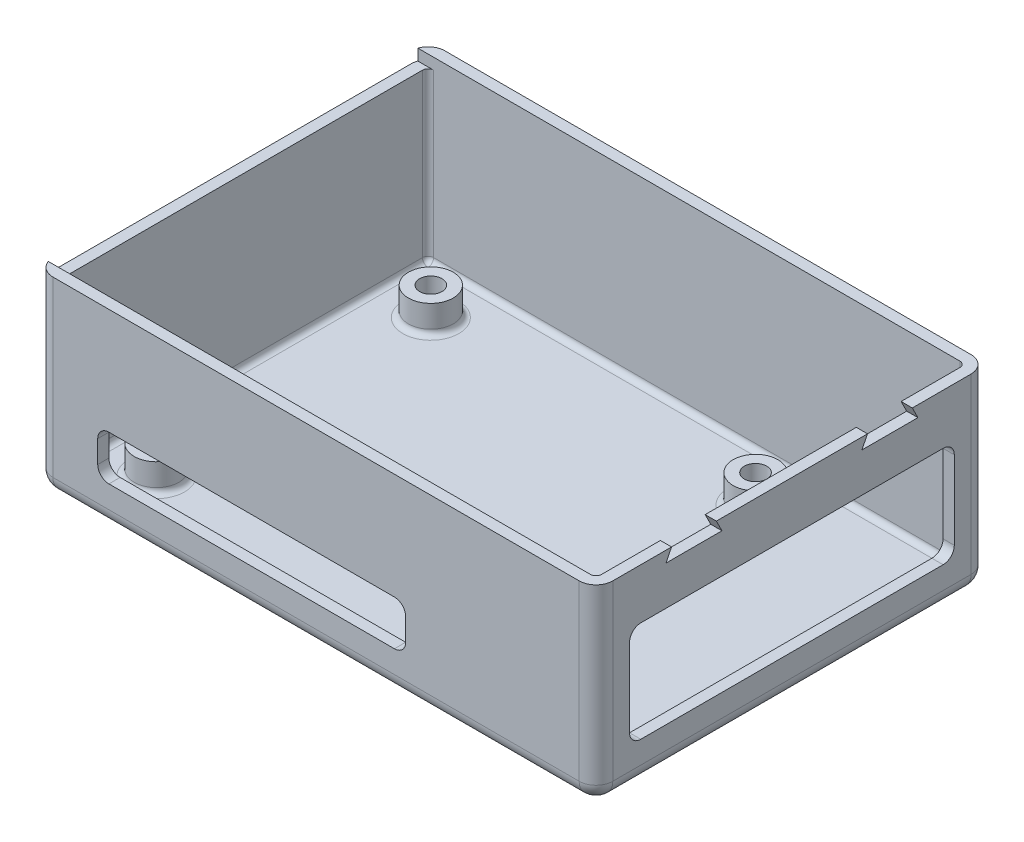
ISO-10303-21;
HEADER;
FILE_DESCRIPTION(('STEP AP214'),'2;1');
FILE_NAME('part.step','',(''),(''),'','','');
FILE_SCHEMA(('AUTOMOTIVE_DESIGN { 1 0 10303 214 1 1 1 1 }'));
ENDSEC;
DATA;
#1=APPLICATION_CONTEXT('core data for automotive mechanical design processes');
#2=APPLICATION_PROTOCOL_DEFINITION('international standard','automotive_design',2000,#1);
#3=PRODUCT_CONTEXT('',#1,'mechanical');
#4=PRODUCT('Part','Part','',(#3));
#5=PRODUCT_RELATED_PRODUCT_CATEGORY('part','',(#4));
#6=PRODUCT_DEFINITION_FORMATION('','',#4);
#7=PRODUCT_DEFINITION_CONTEXT('part definition',#1,'design');
#8=PRODUCT_DEFINITION('design','',#6,#7);
#9=PRODUCT_DEFINITION_SHAPE('','',#8);
#10=(LENGTH_UNIT() NAMED_UNIT(*) SI_UNIT(.MILLI.,.METRE.));
#11=(NAMED_UNIT(*) PLANE_ANGLE_UNIT() SI_UNIT($,.RADIAN.));
#12=(NAMED_UNIT(*) SI_UNIT($,.STERADIAN.) SOLID_ANGLE_UNIT());
#13=UNCERTAINTY_MEASURE_WITH_UNIT(LENGTH_MEASURE(1.E-05),#10,'distance_accuracy_value','');
#14=(GEOMETRIC_REPRESENTATION_CONTEXT(3) GLOBAL_UNCERTAINTY_ASSIGNED_CONTEXT((#13)) GLOBAL_UNIT_ASSIGNED_CONTEXT((#10,
#11,#12)) REPRESENTATION_CONTEXT('',''));
#15=CARTESIAN_POINT('',(0.,0.,0.));
#16=DIRECTION('',(0.,0.,1.));
#17=DIRECTION('',(1.,0.,0.));
#18=AXIS2_PLACEMENT_3D('',#15,#16,#17);
#19=CARTESIAN_POINT('',(0.,34.,0.));
#20=DIRECTION('',(0.,1.,0.));
#21=DIRECTION('',(0.,0.,1.));
#22=AXIS2_PLACEMENT_3D('',#19,#20,#21);
#23=PLANE('',#22);
#24=DIRECTION('',(1.,0.,0.));
#25=VECTOR('',#24,1.);
#26=CARTESIAN_POINT('',(50.,34.,35.));
#27=LINE('',#26,#25);
#28=CARTESIAN_POINT('',(-47.,34.,35.));
#29=VERTEX_POINT('',#28);
#30=CARTESIAN_POINT('',(47.,34.,35.));
#31=VERTEX_POINT('',#30);
#32=EDGE_CURVE('E564',#29,#31,#27,.T.);
#33=ORIENTED_EDGE('',*,*,#32,.T.);
#34=CARTESIAN_POINT('',(47.,34.,32.));
#35=DIRECTION('',(0.,1.,0.));
#36=DIRECTION('',(0.,0.,1.));
#37=AXIS2_PLACEMENT_3D('',#34,#35,#36);
#38=CIRCLE('',#37,3.);
#39=CARTESIAN_POINT('',(50.,34.,32.));
#40=VERTEX_POINT('',#39);
#41=EDGE_CURVE('E724',#31,#40,#38,.T.);
#42=ORIENTED_EDGE('',*,*,#41,.T.);
#43=DIRECTION('',(0.,0.,-1.));
#44=VECTOR('',#43,1.);
#45=CARTESIAN_POINT('',(50.,34.,35.));
#46=LINE('',#45,#44);
#47=CARTESIAN_POINT('',(50.,34.,21.5));
#48=VERTEX_POINT('',#47);
#49=EDGE_CURVE('E568',#40,#48,#46,.T.);
#50=ORIENTED_EDGE('',*,*,#49,.T.);
#51=DIRECTION('',(1.,0.,0.));
#52=VECTOR('',#51,1.);
#53=CARTESIAN_POINT('',(48.,34.,21.5));
#54=LINE('',#53,#52);
#55=CARTESIAN_POINT('',(48.,34.,21.5));
#56=VERTEX_POINT('',#55);
#57=EDGE_CURVE('E484',#56,#48,#54,.T.);
#58=ORIENTED_EDGE('',*,*,#57,.F.);
#59=DIRECTION('',(0.,0.,-1.));
#60=VECTOR('',#59,1.);
#61=CARTESIAN_POINT('',(48.,34.,35.));
#62=LINE('',#61,#60);
#63=CARTESIAN_POINT('',(48.,34.,32.));
#64=VERTEX_POINT('',#63);
#65=EDGE_CURVE('E558',#64,#56,#62,.T.);
#66=ORIENTED_EDGE('',*,*,#65,.F.);
#67=CARTESIAN_POINT('',(47.,34.,32.));
#68=DIRECTION('',(0.,1.,0.));
#69=DIRECTION('',(0.,0.,1.));
#70=AXIS2_PLACEMENT_3D('',#67,#68,#69);
#71=CIRCLE('',#70,1.);
#72=CARTESIAN_POINT('',(47.,34.,33.));
#73=VERTEX_POINT('',#72);
#74=EDGE_CURVE('E647',#64,#73,#71,.F.);
#75=ORIENTED_EDGE('',*,*,#74,.T.);
#76=DIRECTION('',(1.,0.,0.));
#77=VECTOR('',#76,1.);
#78=CARTESIAN_POINT('',(50.,34.,33.));
#79=LINE('',#78,#77);
#80=CARTESIAN_POINT('',(-49.8284271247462,34.,33.));
#81=VERTEX_POINT('',#80);
#82=EDGE_CURVE('E555',#81,#73,#79,.T.);
#83=ORIENTED_EDGE('',*,*,#82,.F.);
#84=CARTESIAN_POINT('',(-47.,34.,32.));
#85=DIRECTION('',(0.,1.,0.));
#86=DIRECTION('',(0.,0.,1.));
#87=AXIS2_PLACEMENT_3D('',#84,#85,#86);
#88=CIRCLE('',#87,3.);
#89=EDGE_CURVE('E722',#81,#29,#88,.T.);
#90=ORIENTED_EDGE('',*,*,#89,.T.);
#91=EDGE_LOOP('',(#33,#42,#50,#58,#66,#75,#83,#90));
#92=FACE_BOUND('',#91,.T.);
#93=ADVANCED_FACE('F38',(#92),#23,.T.);
#94=CARTESIAN_POINT('',(50.,34.,-21.5));
#95=VERTEX_POINT('',#94);
#96=CARTESIAN_POINT('',(50.,34.,-32.));
#97=VERTEX_POINT('',#96);
#98=EDGE_CURVE('E567',#95,#97,#46,.T.);
#99=ORIENTED_EDGE('',*,*,#98,.T.);
#100=CARTESIAN_POINT('',(47.,34.,-32.));
#101=DIRECTION('',(0.,1.,0.));
#102=DIRECTION('',(0.,0.,1.));
#103=AXIS2_PLACEMENT_3D('',#100,#101,#102);
#104=CIRCLE('',#103,3.);
#105=CARTESIAN_POINT('',(47.,34.,-35.));
#106=VERTEX_POINT('',#105);
#107=EDGE_CURVE('E728',#97,#106,#104,.T.);
#108=ORIENTED_EDGE('',*,*,#107,.T.);
#109=DIRECTION('',(-1.,0.,0.));
#110=VECTOR('',#109,1.);
#111=CARTESIAN_POINT('',(50.,34.,-35.));
#112=LINE('',#111,#110);
#113=CARTESIAN_POINT('',(-47.,34.,-35.));
#114=VERTEX_POINT('',#113);
#115=EDGE_CURVE('E570',#106,#114,#112,.T.);
#116=ORIENTED_EDGE('',*,*,#115,.T.);
#117=CARTESIAN_POINT('',(-47.,34.,-32.));
#118=DIRECTION('',(0.,1.,0.));
#119=DIRECTION('',(0.,0.,1.));
#120=AXIS2_PLACEMENT_3D('',#117,#118,#119);
#121=CIRCLE('',#120,3.);
#122=CARTESIAN_POINT('',(-49.8284271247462,34.,-33.));
#123=VERTEX_POINT('',#122);
#124=EDGE_CURVE('E726',#114,#123,#121,.T.);
#125=ORIENTED_EDGE('',*,*,#124,.T.);
#126=DIRECTION('',(-1.,0.,0.));
#127=VECTOR('',#126,1.);
#128=CARTESIAN_POINT('',(50.,34.,-33.));
#129=LINE('',#128,#127);
#130=CARTESIAN_POINT('',(47.,34.,-33.));
#131=VERTEX_POINT('',#130);
#132=EDGE_CURVE('E560',#131,#123,#129,.T.);
#133=ORIENTED_EDGE('',*,*,#132,.F.);
#134=CARTESIAN_POINT('',(47.,34.,-32.));
#135=DIRECTION('',(0.,1.,0.));
#136=DIRECTION('',(0.,0.,1.));
#137=AXIS2_PLACEMENT_3D('',#134,#135,#136);
#138=CIRCLE('',#137,1.);
#139=CARTESIAN_POINT('',(48.,34.,-32.));
#140=VERTEX_POINT('',#139);
#141=EDGE_CURVE('E650',#131,#140,#138,.F.);
#142=ORIENTED_EDGE('',*,*,#141,.T.);
#143=CARTESIAN_POINT('',(48.,34.,-21.5));
#144=VERTEX_POINT('',#143);
#145=EDGE_CURVE('E557',#144,#140,#62,.T.);
#146=ORIENTED_EDGE('',*,*,#145,.F.);
#147=DIRECTION('',(1.,0.,0.));
#148=VECTOR('',#147,1.);
#149=CARTESIAN_POINT('',(48.,34.,-21.5));
#150=LINE('',#149,#148);
#151=EDGE_CURVE('E504',#144,#95,#150,.T.);
#152=ORIENTED_EDGE('',*,*,#151,.T.);
#153=EDGE_LOOP('',(#99,#108,#116,#125,#133,#142,#146,#152));
#154=FACE_BOUND('',#153,.T.);
#155=ADVANCED_FACE('F838',(#154),#23,.T.);
#156=CARTESIAN_POINT('',(-50.,34.,35.));
#157=DIRECTION('',(1.,0.,0.));
#158=DIRECTION('',(0.,0.,-1.));
#159=AXIS2_PLACEMENT_3D('',#156,#157,#158);
#160=PLANE('',#159);
#161=DIRECTION('',(0.,0.,1.));
#162=VECTOR('',#161,1.);
#163=CARTESIAN_POINT('',(-50.,32.,-33.));
#164=LINE('',#163,#162);
#165=CARTESIAN_POINT('',(-50.,32.,-32.));
#166=VERTEX_POINT('',#165);
#167=CARTESIAN_POINT('',(-50.,32.,32.));
#168=VERTEX_POINT('',#167);
#169=EDGE_CURVE('E487',#166,#168,#164,.T.);
#170=ORIENTED_EDGE('',*,*,#169,.F.);
#171=DIRECTION('',(0.,-1.,0.));
#172=VECTOR('',#171,1.);
#173=CARTESIAN_POINT('',(-50.,34.,-32.));
#174=LINE('',#173,#172);
#175=CARTESIAN_POINT('',(-50.,3.,-32.));
#176=VERTEX_POINT('',#175);
#177=EDGE_CURVE('E720',#166,#176,#174,.T.);
#178=ORIENTED_EDGE('',*,*,#177,.T.);
#179=DIRECTION('',(0.,0.,1.));
#180=VECTOR('',#179,1.);
#181=CARTESIAN_POINT('',(-50.,3.,35.));
#182=LINE('',#181,#180);
#183=CARTESIAN_POINT('',(-50.,3.,32.));
#184=VERTEX_POINT('',#183);
#185=EDGE_CURVE('E718',#176,#184,#182,.T.);
#186=ORIENTED_EDGE('',*,*,#185,.T.);
#187=DIRECTION('',(0.,-1.,0.));
#188=VECTOR('',#187,1.);
#189=CARTESIAN_POINT('',(-50.,34.,32.));
#190=LINE('',#189,#188);
#191=EDGE_CURVE('E716',#184,#168,#190,.F.);
#192=ORIENTED_EDGE('',*,*,#191,.T.);
#193=EDGE_LOOP('',(#170,#178,#186,#192));
#194=FACE_BOUND('',#193,.T.);
#195=ADVANCED_FACE('F780',(#194),#160,.F.);
#196=CARTESIAN_POINT('',(50.,34.,35.));
#197=DIRECTION('',(0.,0.,-1.));
#198=DIRECTION('',(-1.,0.,0.));
#199=AXIS2_PLACEMENT_3D('',#196,#197,#198);
#200=PLANE('',#199);
#201=DIRECTION('',(0.,1.,0.));
#202=VECTOR('',#201,1.);
#203=CARTESIAN_POINT('',(16.,9.00000000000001,35.));
#204=LINE('',#203,#202);
#205=CARTESIAN_POINT('',(16.,9.00000000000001,35.));
#206=VERTEX_POINT('',#205);
#207=CARTESIAN_POINT('',(16.,13.,35.));
#208=VERTEX_POINT('',#207);
#209=EDGE_CURVE('E371',#206,#208,#204,.T.);
#210=ORIENTED_EDGE('',*,*,#209,.F.);
#211=CARTESIAN_POINT('',(14.,9.,35.));
#212=DIRECTION('',(0.,0.,1.));
#213=DIRECTION('',(1.,0.,0.));
#214=AXIS2_PLACEMENT_3D('',#211,#212,#213);
#215=CIRCLE('',#214,2.);
#216=CARTESIAN_POINT('',(14.,7.,35.));
#217=VERTEX_POINT('',#216);
#218=EDGE_CURVE('E55',#217,#206,#215,.T.);
#219=ORIENTED_EDGE('',*,*,#218,.F.);
#220=DIRECTION('',(1.,0.,0.));
#221=VECTOR('',#220,1.);
#222=CARTESIAN_POINT('',(-37.,7.,35.));
#223=LINE('',#222,#221);
#224=CARTESIAN_POINT('',(-37.,7.,35.));
#225=VERTEX_POINT('',#224);
#226=EDGE_CURVE('E351',#225,#217,#223,.T.);
#227=ORIENTED_EDGE('',*,*,#226,.F.);
#228=CARTESIAN_POINT('',(-37.,9.,35.));
#229=DIRECTION('',(0.,0.,1.));
#230=DIRECTION('',(-1.,0.,0.));
#231=AXIS2_PLACEMENT_3D('',#228,#229,#230);
#232=CIRCLE('',#231,2.);
#233=CARTESIAN_POINT('',(-39.,9.,35.));
#234=VERTEX_POINT('',#233);
#235=EDGE_CURVE('E354',#234,#225,#232,.T.);
#236=ORIENTED_EDGE('',*,*,#235,.F.);
#237=DIRECTION('',(0.,-1.,0.));
#238=VECTOR('',#237,1.);
#239=CARTESIAN_POINT('',(-39.,9.00000000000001,35.));
#240=LINE('',#239,#238);
#241=CARTESIAN_POINT('',(-39.,13.,35.));
#242=VERTEX_POINT('',#241);
#243=EDGE_CURVE('E382',#242,#234,#240,.T.);
#244=ORIENTED_EDGE('',*,*,#243,.F.);
#245=CARTESIAN_POINT('',(-37.,13.,35.));
#246=DIRECTION('',(0.,0.,1.));
#247=DIRECTION('',(-1.,0.,0.));
#248=AXIS2_PLACEMENT_3D('',#245,#246,#247);
#249=CIRCLE('',#248,2.);
#250=CARTESIAN_POINT('',(-37.,15.,35.));
#251=VERTEX_POINT('',#250);
#252=EDGE_CURVE('E379',#251,#242,#249,.T.);
#253=ORIENTED_EDGE('',*,*,#252,.F.);
#254=DIRECTION('',(-1.,0.,0.));
#255=VECTOR('',#254,1.);
#256=CARTESIAN_POINT('',(-37.,15.,35.));
#257=LINE('',#256,#255);
#258=CARTESIAN_POINT('',(14.,15.,35.));
#259=VERTEX_POINT('',#258);
#260=EDGE_CURVE('E376',#259,#251,#257,.T.);
#261=ORIENTED_EDGE('',*,*,#260,.F.);
#262=CARTESIAN_POINT('',(14.,13.,35.));
#263=DIRECTION('',(0.,0.,1.));
#264=DIRECTION('',(-1.,0.,0.));
#265=AXIS2_PLACEMENT_3D('',#262,#263,#264);
#266=CIRCLE('',#265,2.);
#267=EDGE_CURVE('E373',#208,#259,#266,.T.);
#268=ORIENTED_EDGE('',*,*,#267,.F.);
#269=EDGE_LOOP('',(#210,#219,#227,#236,#244,#253,#261,#268));
#270=FACE_BOUND('',#269,.T.);
#271=DIRECTION('',(1.,0.,0.));
#272=VECTOR('',#271,1.);
#273=CARTESIAN_POINT('',(50.,3.,35.));
#274=LINE('',#273,#272);
#275=CARTESIAN_POINT('',(-47.,3.,35.));
#276=VERTEX_POINT('',#275);
#277=CARTESIAN_POINT('',(47.,3.,35.));
#278=VERTEX_POINT('',#277);
#279=EDGE_CURVE('E690',#276,#278,#274,.T.);
#280=ORIENTED_EDGE('',*,*,#279,.T.);
#281=DIRECTION('',(0.,-1.,0.));
#282=VECTOR('',#281,1.);
#283=CARTESIAN_POINT('',(47.,34.,35.));
#284=LINE('',#283,#282);
#285=EDGE_CURVE('E693',#278,#31,#284,.F.);
#286=ORIENTED_EDGE('',*,*,#285,.T.);
#287=ORIENTED_EDGE('',*,*,#32,.F.);
#288=DIRECTION('',(0.,-1.,0.));
#289=VECTOR('',#288,1.);
#290=CARTESIAN_POINT('',(-47.,34.,35.));
#291=LINE('',#290,#289);
#292=EDGE_CURVE('E655',#29,#276,#291,.T.);
#293=ORIENTED_EDGE('',*,*,#292,.T.);
#294=EDGE_LOOP('',(#280,#286,#287,#293));
#295=FACE_BOUND('',#294,.T.);
#296=ADVANCED_FACE('F872',(#270,#295),#200,.F.);
#297=CARTESIAN_POINT('',(50.,34.,35.));
#298=DIRECTION('',(-1.,0.,0.));
#299=DIRECTION('',(0.,0.,1.));
#300=AXIS2_PLACEMENT_3D('',#297,#298,#299);
#301=PLANE('',#300);
#302=DIRECTION('',(0.,1.,0.));
#303=VECTOR('',#302,1.);
#304=CARTESIAN_POINT('',(50.,9.00000000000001,-29.));
#305=LINE('',#304,#303);
#306=CARTESIAN_POINT('',(50.,9.00000000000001,-29.));
#307=VERTEX_POINT('',#306);
#308=CARTESIAN_POINT('',(50.,23.,-29.));
#309=VERTEX_POINT('',#308);
#310=EDGE_CURVE('E428',#307,#309,#305,.T.);
#311=ORIENTED_EDGE('',*,*,#310,.F.);
#312=CARTESIAN_POINT('',(50.,8.99999999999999,-27.));
#313=DIRECTION('',(1.,0.,0.));
#314=DIRECTION('',(0.,0.,1.));
#315=AXIS2_PLACEMENT_3D('',#312,#313,#314);
#316=CIRCLE('',#315,2.);
#317=CARTESIAN_POINT('',(50.,6.99999999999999,-27.));
#318=VERTEX_POINT('',#317);
#319=EDGE_CURVE('E389',#318,#307,#316,.T.);
#320=ORIENTED_EDGE('',*,*,#319,.F.);
#321=DIRECTION('',(0.,0.,-1.));
#322=VECTOR('',#321,1.);
#323=CARTESIAN_POINT('',(50.,6.99999999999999,27.));
#324=LINE('',#323,#322);
#325=CARTESIAN_POINT('',(50.,6.99999999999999,27.));
#326=VERTEX_POINT('',#325);
#327=EDGE_CURVE('E405',#326,#318,#324,.T.);
#328=ORIENTED_EDGE('',*,*,#327,.F.);
#329=CARTESIAN_POINT('',(50.,8.99999999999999,27.));
#330=DIRECTION('',(1.,0.,0.));
#331=DIRECTION('',(0.,0.,-1.));
#332=AXIS2_PLACEMENT_3D('',#329,#330,#331);
#333=CIRCLE('',#332,2.);
#334=CARTESIAN_POINT('',(50.,9.00000000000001,29.));
#335=VERTEX_POINT('',#334);
#336=EDGE_CURVE('E443',#335,#326,#333,.T.);
#337=ORIENTED_EDGE('',*,*,#336,.F.);
#338=DIRECTION('',(0.,-1.,0.));
#339=VECTOR('',#338,1.);
#340=CARTESIAN_POINT('',(50.,9.00000000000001,29.));
#341=LINE('',#340,#339);
#342=CARTESIAN_POINT('',(50.,23.,29.));
#343=VERTEX_POINT('',#342);
#344=EDGE_CURVE('E440',#343,#335,#341,.T.);
#345=ORIENTED_EDGE('',*,*,#344,.F.);
#346=CARTESIAN_POINT('',(50.,23.,27.));
#347=DIRECTION('',(1.,0.,0.));
#348=DIRECTION('',(0.,0.,1.));
#349=AXIS2_PLACEMENT_3D('',#346,#347,#348);
#350=CIRCLE('',#349,2.);
#351=CARTESIAN_POINT('',(50.,25.,27.));
#352=VERTEX_POINT('',#351);
#353=EDGE_CURVE('E437',#352,#343,#350,.T.);
#354=ORIENTED_EDGE('',*,*,#353,.F.);
#355=DIRECTION('',(0.,0.,1.));
#356=VECTOR('',#355,1.);
#357=CARTESIAN_POINT('',(50.,25.,27.));
#358=LINE('',#357,#356);
#359=CARTESIAN_POINT('',(50.,25.,-27.));
#360=VERTEX_POINT('',#359);
#361=EDGE_CURVE('E434',#360,#352,#358,.T.);
#362=ORIENTED_EDGE('',*,*,#361,.F.);
#363=CARTESIAN_POINT('',(50.,23.,-27.));
#364=DIRECTION('',(1.,0.,0.));
#365=DIRECTION('',(0.,0.,1.));
#366=AXIS2_PLACEMENT_3D('',#363,#364,#365);
#367=CIRCLE('',#366,2.);
#368=EDGE_CURVE('E431',#309,#360,#367,.T.);
#369=ORIENTED_EDGE('',*,*,#368,.F.);
#370=EDGE_LOOP('',(#311,#320,#328,#337,#345,#354,#362,#369));
#371=FACE_BOUND('',#370,.T.);
#372=ORIENTED_EDGE('',*,*,#49,.F.);
#373=DIRECTION('',(0.,-1.,0.));
#374=VECTOR('',#373,1.);
#375=CARTESIAN_POINT('',(50.,34.,32.));
#376=LINE('',#375,#374);
#377=CARTESIAN_POINT('',(50.,3.,32.));
#378=VERTEX_POINT('',#377);
#379=EDGE_CURVE('E708',#40,#378,#376,.T.);
#380=ORIENTED_EDGE('',*,*,#379,.T.);
#381=DIRECTION('',(0.,0.,-1.));
#382=VECTOR('',#381,1.);
#383=CARTESIAN_POINT('',(50.,3.,35.));
#384=LINE('',#383,#382);
#385=CARTESIAN_POINT('',(50.,3.,-32.));
#386=VERTEX_POINT('',#385);
#387=EDGE_CURVE('E706',#378,#386,#384,.T.);
#388=ORIENTED_EDGE('',*,*,#387,.T.);
#389=DIRECTION('',(0.,-1.,0.));
#390=VECTOR('',#389,1.);
#391=CARTESIAN_POINT('',(50.,34.,-32.));
#392=LINE('',#391,#390);
#393=EDGE_CURVE('E704',#386,#97,#392,.F.);
#394=ORIENTED_EDGE('',*,*,#393,.T.);
#395=ORIENTED_EDGE('',*,*,#98,.F.);
#396=DIRECTION('',(0.,0.894427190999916,0.447213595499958));
#397=VECTOR('',#396,1.);
#398=CARTESIAN_POINT('',(50.,34.,-21.5));
#399=LINE('',#398,#397);
#400=CARTESIAN_POINT('',(50.,32.,-22.5));
#401=VERTEX_POINT('',#400);
#402=EDGE_CURVE('E505',#401,#95,#399,.T.);
#403=ORIENTED_EDGE('',*,*,#402,.F.);
#404=DIRECTION('',(0.,0.,-1.));
#405=VECTOR('',#404,1.);
#406=CARTESIAN_POINT('',(50.,32.,-12.5));
#407=LINE('',#406,#405);
#408=CARTESIAN_POINT('',(50.,32.,-12.5));
#409=VERTEX_POINT('',#408);
#410=EDGE_CURVE('E498',#409,#401,#407,.T.);
#411=ORIENTED_EDGE('',*,*,#410,.F.);
#412=DIRECTION('',(0.,-0.894427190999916,0.447213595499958));
#413=VECTOR('',#412,1.);
#414=CARTESIAN_POINT('',(50.,34.,-13.5));
#415=LINE('',#414,#413);
#416=CARTESIAN_POINT('',(50.,34.,-13.5));
#417=VERTEX_POINT('',#416);
#418=EDGE_CURVE('E507',#417,#409,#415,.T.);
#419=ORIENTED_EDGE('',*,*,#418,.F.);
#420=CARTESIAN_POINT('',(50.,34.,13.5));
#421=VERTEX_POINT('',#420);
#422=EDGE_CURVE('E571',#421,#417,#46,.T.);
#423=ORIENTED_EDGE('',*,*,#422,.F.);
#424=DIRECTION('',(0.,0.894427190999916,0.447213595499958));
#425=VECTOR('',#424,1.);
#426=CARTESIAN_POINT('',(50.,34.,13.5));
#427=LINE('',#426,#425);
#428=CARTESIAN_POINT('',(50.,32.,12.5));
#429=VERTEX_POINT('',#428);
#430=EDGE_CURVE('E469',#429,#421,#427,.T.);
#431=ORIENTED_EDGE('',*,*,#430,.F.);
#432=DIRECTION('',(0.,0.,-1.));
#433=VECTOR('',#432,1.);
#434=CARTESIAN_POINT('',(50.,32.,12.5));
#435=LINE('',#434,#433);
#436=CARTESIAN_POINT('',(50.,32.,22.5));
#437=VERTEX_POINT('',#436);
#438=EDGE_CURVE('E479',#437,#429,#435,.T.);
#439=ORIENTED_EDGE('',*,*,#438,.F.);
#440=DIRECTION('',(0.,-0.894427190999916,0.447213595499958));
#441=VECTOR('',#440,1.);
#442=CARTESIAN_POINT('',(50.,34.,21.5));
#443=LINE('',#442,#441);
#444=EDGE_CURVE('E476',#48,#437,#443,.T.);
#445=ORIENTED_EDGE('',*,*,#444,.F.);
#446=EDGE_LOOP('',(#372,#380,#388,#394,#395,#403,#411,#419,#423,#431,#439,#445));
#447=FACE_BOUND('',#446,.T.);
#448=ADVANCED_FACE('F926',(#371,#447),#301,.F.);
#449=CARTESIAN_POINT('',(50.,34.,-35.));
#450=DIRECTION('',(0.,0.,1.));
#451=DIRECTION('',(1.,0.,0.));
#452=AXIS2_PLACEMENT_3D('',#449,#450,#451);
#453=PLANE('',#452);
#454=ORIENTED_EDGE('',*,*,#115,.F.);
#455=DIRECTION('',(0.,-1.,0.));
#456=VECTOR('',#455,1.);
#457=CARTESIAN_POINT('',(47.,34.,-35.));
#458=LINE('',#457,#456);
#459=CARTESIAN_POINT('',(47.,3.,-35.));
#460=VERTEX_POINT('',#459);
#461=EDGE_CURVE('E714',#106,#460,#458,.T.);
#462=ORIENTED_EDGE('',*,*,#461,.T.);
#463=DIRECTION('',(-1.,0.,0.));
#464=VECTOR('',#463,1.);
#465=CARTESIAN_POINT('',(50.,3.,-35.));
#466=LINE('',#465,#464);
#467=CARTESIAN_POINT('',(-47.,3.,-35.));
#468=VERTEX_POINT('',#467);
#469=EDGE_CURVE('E712',#460,#468,#466,.T.);
#470=ORIENTED_EDGE('',*,*,#469,.T.);
#471=DIRECTION('',(0.,-1.,0.));
#472=VECTOR('',#471,1.);
#473=CARTESIAN_POINT('',(-47.,34.,-35.));
#474=LINE('',#473,#472);
#475=EDGE_CURVE('E710',#468,#114,#474,.F.);
#476=ORIENTED_EDGE('',*,*,#475,.T.);
#477=EDGE_LOOP('',(#454,#462,#470,#476));
#478=FACE_BOUND('',#477,.T.);
#479=ADVANCED_FACE('F834',(#478),#453,.F.);
#480=DIRECTION('',(1.,0.,0.));
#481=VECTOR('',#480,1.);
#482=CARTESIAN_POINT('',(48.,34.,13.5));
#483=LINE('',#482,#481);
#484=CARTESIAN_POINT('',(48.,34.,13.5));
#485=VERTEX_POINT('',#484);
#486=EDGE_CURVE('E488',#485,#421,#483,.T.);
#487=ORIENTED_EDGE('',*,*,#486,.T.);
#488=ORIENTED_EDGE('',*,*,#422,.T.);
#489=DIRECTION('',(1.,0.,0.));
#490=VECTOR('',#489,1.);
#491=CARTESIAN_POINT('',(48.,34.,-13.5));
#492=LINE('',#491,#490);
#493=CARTESIAN_POINT('',(48.,34.,-13.5));
#494=VERTEX_POINT('',#493);
#495=EDGE_CURVE('E516',#494,#417,#492,.T.);
#496=ORIENTED_EDGE('',*,*,#495,.F.);
#497=EDGE_CURVE('E561',#485,#494,#62,.T.);
#498=ORIENTED_EDGE('',*,*,#497,.F.);
#499=EDGE_LOOP('',(#487,#488,#496,#498));
#500=FACE_BOUND('',#499,.T.);
#501=ADVANCED_FACE('F912',(#500),#23,.T.);
#502=CARTESIAN_POINT('',(0.,0.,0.));
#503=DIRECTION('',(0.,1.,0.));
#504=DIRECTION('',(0.,0.,1.));
#505=AXIS2_PLACEMENT_3D('',#502,#503,#504);
#506=PLANE('',#505);
#507=DIRECTION('',(0.,0.,-1.));
#508=VECTOR('',#507,1.);
#509=CARTESIAN_POINT('',(47.,0.,0.));
#510=LINE('',#509,#508);
#511=CARTESIAN_POINT('',(47.,0.,-32.));
#512=VERTEX_POINT('',#511);
#513=CARTESIAN_POINT('',(47.,0.,32.));
#514=VERTEX_POINT('',#513);
#515=EDGE_CURVE('E699',#512,#514,#510,.F.);
#516=ORIENTED_EDGE('',*,*,#515,.T.);
#517=DIRECTION('',(1.,0.,0.));
#518=VECTOR('',#517,1.);
#519=CARTESIAN_POINT('',(0.,0.,32.));
#520=LINE('',#519,#518);
#521=CARTESIAN_POINT('',(-47.,0.,32.));
#522=VERTEX_POINT('',#521);
#523=EDGE_CURVE('E701',#514,#522,#520,.F.);
#524=ORIENTED_EDGE('',*,*,#523,.T.);
#525=DIRECTION('',(0.,0.,1.));
#526=VECTOR('',#525,1.);
#527=CARTESIAN_POINT('',(-47.,0.,0.));
#528=LINE('',#527,#526);
#529=CARTESIAN_POINT('',(-47.,0.,-32.));
#530=VERTEX_POINT('',#529);
#531=EDGE_CURVE('E695',#522,#530,#528,.F.);
#532=ORIENTED_EDGE('',*,*,#531,.T.);
#533=DIRECTION('',(-1.,0.,0.));
#534=VECTOR('',#533,1.);
#535=CARTESIAN_POINT('',(0.,0.,-32.));
#536=LINE('',#535,#534);
#537=EDGE_CURVE('E697',#530,#512,#536,.F.);
#538=ORIENTED_EDGE('',*,*,#537,.T.);
#539=EDGE_LOOP('',(#516,#524,#532,#538));
#540=FACE_BOUND('',#539,.T.);
#541=ADVANCED_FACE('F857',(#540),#506,.F.);
#542=CARTESIAN_POINT('',(-48.,34.,35.));
#543=DIRECTION('',(1.,0.,0.));
#544=DIRECTION('',(0.,0.,-1.));
#545=AXIS2_PLACEMENT_3D('',#542,#543,#544);
#546=PLANE('',#545);
#547=DIRECTION('',(0.,0.,-1.));
#548=VECTOR('',#547,1.);
#549=CARTESIAN_POINT('',(-48.,32.,35.));
#550=LINE('',#549,#548);
#551=CARTESIAN_POINT('',(-48.,32.,32.));
#552=VERTEX_POINT('',#551);
#553=CARTESIAN_POINT('',(-48.,32.,-32.));
#554=VERTEX_POINT('',#553);
#555=EDGE_CURVE('E526',#552,#554,#550,.T.);
#556=ORIENTED_EDGE('',*,*,#555,.F.);
#557=DIRECTION('',(0.,-1.,0.));
#558=VECTOR('',#557,1.);
#559=CARTESIAN_POINT('',(-48.,2.,32.));
#560=LINE('',#559,#558);
#561=CARTESIAN_POINT('',(-48.,3.,32.));
#562=VERTEX_POINT('',#561);
#563=EDGE_CURVE('E631',#552,#562,#560,.T.);
#564=ORIENTED_EDGE('',*,*,#563,.T.);
#565=DIRECTION('',(0.,0.,1.));
#566=VECTOR('',#565,1.);
#567=CARTESIAN_POINT('',(-48.,3.,-33.));
#568=LINE('',#567,#566);
#569=CARTESIAN_POINT('',(-48.,3.,-32.));
#570=VERTEX_POINT('',#569);
#571=EDGE_CURVE('E629',#562,#570,#568,.F.);
#572=ORIENTED_EDGE('',*,*,#571,.T.);
#573=DIRECTION('',(0.,-1.,0.));
#574=VECTOR('',#573,1.);
#575=CARTESIAN_POINT('',(-48.,32.,-32.));
#576=LINE('',#575,#574);
#577=EDGE_CURVE('E627',#570,#554,#576,.F.);
#578=ORIENTED_EDGE('',*,*,#577,.T.);
#579=EDGE_LOOP('',(#556,#564,#572,#578));
#580=FACE_BOUND('',#579,.T.);
#581=ADVANCED_FACE('F804',(#580),#546,.T.);
#582=CARTESIAN_POINT('',(50.,34.,33.));
#583=DIRECTION('',(0.,0.,-1.));
#584=DIRECTION('',(-1.,0.,0.));
#585=AXIS2_PLACEMENT_3D('',#582,#583,#584);
#586=PLANE('',#585);
#587=CARTESIAN_POINT('',(14.,9.,33.));
#588=DIRECTION('',(0.,0.,1.));
#589=DIRECTION('',(1.,0.,0.));
#590=AXIS2_PLACEMENT_3D('',#587,#588,#589);
#591=CIRCLE('',#590,2.);
#592=CARTESIAN_POINT('',(14.,7.,33.));
#593=VERTEX_POINT('',#592);
#594=CARTESIAN_POINT('',(16.,9.00000000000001,33.));
#595=VERTEX_POINT('',#594);
#596=EDGE_CURVE('E334',#593,#595,#591,.T.);
#597=ORIENTED_EDGE('',*,*,#596,.T.);
#598=DIRECTION('',(0.,1.,0.));
#599=VECTOR('',#598,1.);
#600=CARTESIAN_POINT('',(16.,9.00000000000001,33.));
#601=LINE('',#600,#599);
#602=CARTESIAN_POINT('',(16.,13.,33.));
#603=VERTEX_POINT('',#602);
#604=EDGE_CURVE('E343',#595,#603,#601,.T.);
#605=ORIENTED_EDGE('',*,*,#604,.T.);
#606=CARTESIAN_POINT('',(14.,13.,33.));
#607=DIRECTION('',(0.,0.,1.));
#608=DIRECTION('',(-1.,0.,0.));
#609=AXIS2_PLACEMENT_3D('',#606,#607,#608);
#610=CIRCLE('',#609,2.);
#611=CARTESIAN_POINT('',(14.,15.,33.));
#612=VERTEX_POINT('',#611);
#613=EDGE_CURVE('E63',#603,#612,#610,.T.);
#614=ORIENTED_EDGE('',*,*,#613,.T.);
#615=DIRECTION('',(-1.,0.,0.));
#616=VECTOR('',#615,1.);
#617=CARTESIAN_POINT('',(-37.,15.,33.));
#618=LINE('',#617,#616);
#619=CARTESIAN_POINT('',(-37.,15.,33.));
#620=VERTEX_POINT('',#619);
#621=EDGE_CURVE('E358',#612,#620,#618,.T.);
#622=ORIENTED_EDGE('',*,*,#621,.T.);
#623=CARTESIAN_POINT('',(-37.,13.,33.));
#624=DIRECTION('',(0.,0.,1.));
#625=DIRECTION('',(-1.,0.,0.));
#626=AXIS2_PLACEMENT_3D('',#623,#624,#625);
#627=CIRCLE('',#626,2.);
#628=CARTESIAN_POINT('',(-39.,13.,33.));
#629=VERTEX_POINT('',#628);
#630=EDGE_CURVE('E361',#620,#629,#627,.T.);
#631=ORIENTED_EDGE('',*,*,#630,.T.);
#632=DIRECTION('',(0.,-1.,0.));
#633=VECTOR('',#632,1.);
#634=CARTESIAN_POINT('',(-39.,9.00000000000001,33.));
#635=LINE('',#634,#633);
#636=CARTESIAN_POINT('',(-39.,9.,33.));
#637=VERTEX_POINT('',#636);
#638=EDGE_CURVE('E364',#629,#637,#635,.T.);
#639=ORIENTED_EDGE('',*,*,#638,.T.);
#640=CARTESIAN_POINT('',(-37.,9.,33.));
#641=DIRECTION('',(0.,0.,1.));
#642=DIRECTION('',(-1.,0.,0.));
#643=AXIS2_PLACEMENT_3D('',#640,#641,#642);
#644=CIRCLE('',#643,2.);
#645=CARTESIAN_POINT('',(-37.,7.,33.));
#646=VERTEX_POINT('',#645);
#647=EDGE_CURVE('E367',#637,#646,#644,.T.);
#648=ORIENTED_EDGE('',*,*,#647,.T.);
#649=DIRECTION('',(1.,0.,0.));
#650=VECTOR('',#649,1.);
#651=CARTESIAN_POINT('',(-37.,7.,33.));
#652=LINE('',#651,#650);
#653=EDGE_CURVE('E340',#646,#593,#652,.T.);
#654=ORIENTED_EDGE('',*,*,#653,.T.);
#655=EDGE_LOOP('',(#597,#605,#614,#622,#631,#639,#648,#654));
#656=FACE_BOUND('',#655,.T.);
#657=DIRECTION('',(-1.,0.,0.));
#658=VECTOR('',#657,1.);
#659=CARTESIAN_POINT('',(114.030296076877,32.,33.));
#660=LINE('',#659,#658);
#661=CARTESIAN_POINT('',(-47.,32.,33.));
#662=VERTEX_POINT('',#661);
#663=CARTESIAN_POINT('',(-49.8284271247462,32.,33.));
#664=VERTEX_POINT('',#663);
#665=EDGE_CURVE('E523',#662,#664,#660,.T.);
#666=ORIENTED_EDGE('',*,*,#665,.T.);
#667=DIRECTION('',(0.,-1.,0.));
#668=VECTOR('',#667,1.);
#669=CARTESIAN_POINT('',(-49.8284271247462,32.,33.));
#670=LINE('',#669,#668);
#671=EDGE_CURVE('E11',#664,#81,#670,.F.);
#672=ORIENTED_EDGE('',*,*,#671,.T.);
#673=ORIENTED_EDGE('',*,*,#82,.T.);
#674=DIRECTION('',(0.,-1.,0.));
#675=VECTOR('',#674,1.);
#676=CARTESIAN_POINT('',(47.,2.,33.));
#677=LINE('',#676,#675);
#678=CARTESIAN_POINT('',(47.,3.,33.));
#679=VERTEX_POINT('',#678);
#680=EDGE_CURVE('E620',#73,#679,#677,.T.);
#681=ORIENTED_EDGE('',*,*,#680,.T.);
#682=DIRECTION('',(1.,0.,0.));
#683=VECTOR('',#682,1.);
#684=CARTESIAN_POINT('',(-48.,3.,33.));
#685=LINE('',#684,#683);
#686=CARTESIAN_POINT('',(-47.,3.,33.));
#687=VERTEX_POINT('',#686);
#688=EDGE_CURVE('E622',#679,#687,#685,.F.);
#689=ORIENTED_EDGE('',*,*,#688,.T.);
#690=DIRECTION('',(0.,-1.,0.));
#691=VECTOR('',#690,1.);
#692=CARTESIAN_POINT('',(-47.,32.,33.));
#693=LINE('',#692,#691);
#694=EDGE_CURVE('E624',#687,#662,#693,.F.);
#695=ORIENTED_EDGE('',*,*,#694,.T.);
#696=EDGE_LOOP('',(#666,#672,#673,#681,#689,#695));
#697=FACE_BOUND('',#696,.T.);
#698=ADVANCED_FACE('F347',(#656,#697),#586,.T.);
#699=CARTESIAN_POINT('',(48.,34.,35.));
#700=DIRECTION('',(-1.,0.,0.));
#701=DIRECTION('',(0.,0.,1.));
#702=AXIS2_PLACEMENT_3D('',#699,#700,#701);
#703=PLANE('',#702);
#704=CARTESIAN_POINT('',(48.,8.99999999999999,-27.));
#705=DIRECTION('',(1.,0.,0.));
#706=DIRECTION('',(0.,0.,1.));
#707=AXIS2_PLACEMENT_3D('',#704,#705,#706);
#708=CIRCLE('',#707,2.);
#709=CARTESIAN_POINT('',(48.,6.99999999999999,-27.));
#710=VERTEX_POINT('',#709);
#711=CARTESIAN_POINT('',(48.,9.00000000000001,-29.));
#712=VERTEX_POINT('',#711);
#713=EDGE_CURVE('E401',#710,#712,#708,.T.);
#714=ORIENTED_EDGE('',*,*,#713,.T.);
#715=DIRECTION('',(0.,1.,0.));
#716=VECTOR('',#715,1.);
#717=CARTESIAN_POINT('',(48.,9.00000000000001,-29.));
#718=LINE('',#717,#716);
#719=CARTESIAN_POINT('',(48.,23.,-29.));
#720=VERTEX_POINT('',#719);
#721=EDGE_CURVE('E404',#712,#720,#718,.T.);
#722=ORIENTED_EDGE('',*,*,#721,.T.);
#723=CARTESIAN_POINT('',(48.,23.,-27.));
#724=DIRECTION('',(1.,0.,0.));
#725=DIRECTION('',(0.,0.,1.));
#726=AXIS2_PLACEMENT_3D('',#723,#724,#725);
#727=CIRCLE('',#726,2.);
#728=CARTESIAN_POINT('',(48.,25.,-27.));
#729=VERTEX_POINT('',#728);
#730=EDGE_CURVE('E408',#720,#729,#727,.T.);
#731=ORIENTED_EDGE('',*,*,#730,.T.);
#732=DIRECTION('',(0.,0.,1.));
#733=VECTOR('',#732,1.);
#734=CARTESIAN_POINT('',(48.,25.,27.));
#735=LINE('',#734,#733);
#736=CARTESIAN_POINT('',(48.,25.,27.));
#737=VERTEX_POINT('',#736);
#738=EDGE_CURVE('E411',#729,#737,#735,.T.);
#739=ORIENTED_EDGE('',*,*,#738,.T.);
#740=CARTESIAN_POINT('',(48.,23.,27.));
#741=DIRECTION('',(1.,0.,0.));
#742=DIRECTION('',(0.,0.,1.));
#743=AXIS2_PLACEMENT_3D('',#740,#741,#742);
#744=CIRCLE('',#743,2.);
#745=CARTESIAN_POINT('',(48.,23.,29.));
#746=VERTEX_POINT('',#745);
#747=EDGE_CURVE('E414',#737,#746,#744,.T.);
#748=ORIENTED_EDGE('',*,*,#747,.T.);
#749=DIRECTION('',(0.,-1.,0.));
#750=VECTOR('',#749,1.);
#751=CARTESIAN_POINT('',(48.,9.00000000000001,29.));
#752=LINE('',#751,#750);
#753=CARTESIAN_POINT('',(48.,9.00000000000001,29.));
#754=VERTEX_POINT('',#753);
#755=EDGE_CURVE('E417',#746,#754,#752,.T.);
#756=ORIENTED_EDGE('',*,*,#755,.T.);
#757=CARTESIAN_POINT('',(48.,8.99999999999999,27.));
#758=DIRECTION('',(1.,0.,0.));
#759=DIRECTION('',(0.,0.,-1.));
#760=AXIS2_PLACEMENT_3D('',#757,#758,#759);
#761=CIRCLE('',#760,2.);
#762=CARTESIAN_POINT('',(48.,6.99999999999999,27.));
#763=VERTEX_POINT('',#762);
#764=EDGE_CURVE('E420',#754,#763,#761,.T.);
#765=ORIENTED_EDGE('',*,*,#764,.T.);
#766=DIRECTION('',(0.,0.,-1.));
#767=VECTOR('',#766,1.);
#768=CARTESIAN_POINT('',(48.,6.99999999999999,27.));
#769=LINE('',#768,#767);
#770=EDGE_CURVE('E423',#763,#710,#769,.T.);
#771=ORIENTED_EDGE('',*,*,#770,.T.);
#772=EDGE_LOOP('',(#714,#722,#731,#739,#748,#756,#765,#771));
#773=FACE_BOUND('',#772,.T.);
#774=DIRECTION('',(0.,0.,-1.));
#775=VECTOR('',#774,1.);
#776=CARTESIAN_POINT('',(48.,3.,33.));
#777=LINE('',#776,#775);
#778=CARTESIAN_POINT('',(48.,3.,-32.));
#779=VERTEX_POINT('',#778);
#780=CARTESIAN_POINT('',(48.,3.,32.));
#781=VERTEX_POINT('',#780);
#782=EDGE_CURVE('E616',#779,#781,#777,.F.);
#783=ORIENTED_EDGE('',*,*,#782,.T.);
#784=DIRECTION('',(0.,-1.,0.));
#785=VECTOR('',#784,1.);
#786=CARTESIAN_POINT('',(48.,34.,32.));
#787=LINE('',#786,#785);
#788=EDGE_CURVE('E618',#781,#64,#787,.F.);
#789=ORIENTED_EDGE('',*,*,#788,.T.);
#790=ORIENTED_EDGE('',*,*,#65,.T.);
#791=DIRECTION('',(0.,-0.894427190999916,0.447213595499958));
#792=VECTOR('',#791,1.);
#793=CARTESIAN_POINT('',(48.,34.,21.5));
#794=LINE('',#793,#792);
#795=CARTESIAN_POINT('',(48.,32.,22.5));
#796=VERTEX_POINT('',#795);
#797=EDGE_CURVE('E465',#56,#796,#794,.T.);
#798=ORIENTED_EDGE('',*,*,#797,.T.);
#799=DIRECTION('',(0.,0.,-1.));
#800=VECTOR('',#799,1.);
#801=CARTESIAN_POINT('',(48.,32.,12.5));
#802=LINE('',#801,#800);
#803=CARTESIAN_POINT('',(48.,32.,12.5));
#804=VERTEX_POINT('',#803);
#805=EDGE_CURVE('E468',#796,#804,#802,.T.);
#806=ORIENTED_EDGE('',*,*,#805,.T.);
#807=DIRECTION('',(0.,0.894427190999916,0.447213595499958));
#808=VECTOR('',#807,1.);
#809=CARTESIAN_POINT('',(48.,34.,13.5));
#810=LINE('',#809,#808);
#811=EDGE_CURVE('E472',#804,#485,#810,.T.);
#812=ORIENTED_EDGE('',*,*,#811,.T.);
#813=ORIENTED_EDGE('',*,*,#497,.T.);
#814=DIRECTION('',(0.,-0.894427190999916,0.447213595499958));
#815=VECTOR('',#814,1.);
#816=CARTESIAN_POINT('',(48.,34.,-13.5));
#817=LINE('',#816,#815);
#818=CARTESIAN_POINT('',(48.,32.,-12.5));
#819=VERTEX_POINT('',#818);
#820=EDGE_CURVE('E497',#494,#819,#817,.T.);
#821=ORIENTED_EDGE('',*,*,#820,.T.);
#822=DIRECTION('',(0.,0.,-1.));
#823=VECTOR('',#822,1.);
#824=CARTESIAN_POINT('',(48.,32.,-12.5));
#825=LINE('',#824,#823);
#826=CARTESIAN_POINT('',(48.,32.,-22.5));
#827=VERTEX_POINT('',#826);
#828=EDGE_CURVE('E501',#819,#827,#825,.T.);
#829=ORIENTED_EDGE('',*,*,#828,.T.);
#830=DIRECTION('',(0.,0.894427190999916,0.447213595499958));
#831=VECTOR('',#830,1.);
#832=CARTESIAN_POINT('',(48.,34.,-21.5));
#833=LINE('',#832,#831);
#834=EDGE_CURVE('E494',#827,#144,#833,.T.);
#835=ORIENTED_EDGE('',*,*,#834,.T.);
#836=ORIENTED_EDGE('',*,*,#145,.T.);
#837=DIRECTION('',(0.,-1.,0.));
#838=VECTOR('',#837,1.);
#839=CARTESIAN_POINT('',(48.,2.,-32.));
#840=LINE('',#839,#838);
#841=EDGE_CURVE('E614',#140,#779,#840,.T.);
#842=ORIENTED_EDGE('',*,*,#841,.T.);
#843=EDGE_LOOP('',(#783,#789,#790,#798,#806,#812,#813,#821,#829,#835,#836,#842));
#844=FACE_BOUND('',#843,.T.);
#845=ADVANCED_FACE('F945',(#773,#844),#703,.T.);
#846=CARTESIAN_POINT('',(50.,34.,-33.));
#847=DIRECTION('',(0.,0.,1.));
#848=DIRECTION('',(1.,0.,0.));
#849=AXIS2_PLACEMENT_3D('',#846,#847,#848);
#850=PLANE('',#849);
#851=ORIENTED_EDGE('',*,*,#132,.T.);
#852=DIRECTION('',(0.,-1.,0.));
#853=VECTOR('',#852,1.);
#854=CARTESIAN_POINT('',(-49.8284271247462,34.,-33.));
#855=LINE('',#854,#853);
#856=CARTESIAN_POINT('',(-49.8284271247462,32.,-33.));
#857=VERTEX_POINT('',#856);
#858=EDGE_CURVE('E730',#123,#857,#855,.T.);
#859=ORIENTED_EDGE('',*,*,#858,.T.);
#860=DIRECTION('',(-1.,0.,0.));
#861=VECTOR('',#860,1.);
#862=CARTESIAN_POINT('',(114.030296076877,32.,-33.));
#863=LINE('',#862,#861);
#864=CARTESIAN_POINT('',(-47.,32.,-33.));
#865=VERTEX_POINT('',#864);
#866=EDGE_CURVE('E522',#865,#857,#863,.T.);
#867=ORIENTED_EDGE('',*,*,#866,.F.);
#868=DIRECTION('',(0.,-1.,0.));
#869=VECTOR('',#868,1.);
#870=CARTESIAN_POINT('',(-47.,2.,-33.));
#871=LINE('',#870,#869);
#872=CARTESIAN_POINT('',(-47.,3.,-33.));
#873=VERTEX_POINT('',#872);
#874=EDGE_CURVE('E607',#865,#873,#871,.T.);
#875=ORIENTED_EDGE('',*,*,#874,.T.);
#876=DIRECTION('',(-1.,0.,0.));
#877=VECTOR('',#876,1.);
#878=CARTESIAN_POINT('',(48.,3.,-33.));
#879=LINE('',#878,#877);
#880=CARTESIAN_POINT('',(47.,3.,-33.));
#881=VERTEX_POINT('',#880);
#882=EDGE_CURVE('E609',#873,#881,#879,.F.);
#883=ORIENTED_EDGE('',*,*,#882,.T.);
#884=DIRECTION('',(0.,-1.,0.));
#885=VECTOR('',#884,1.);
#886=CARTESIAN_POINT('',(47.,34.,-33.));
#887=LINE('',#886,#885);
#888=EDGE_CURVE('E612',#881,#131,#887,.F.);
#889=ORIENTED_EDGE('',*,*,#888,.T.);
#890=EDGE_LOOP('',(#851,#859,#867,#875,#883,#889));
#891=FACE_BOUND('',#890,.T.);
#892=ADVANCED_FACE('F824',(#891),#850,.T.);
#893=CARTESIAN_POINT('',(0.,2.,0.));
#894=DIRECTION('',(0.,1.,0.));
#895=DIRECTION('',(0.,0.,1.));
#896=AXIS2_PLACEMENT_3D('',#893,#894,#895);
#897=PLANE('',#896);
#898=DIRECTION('',(0.,0.,-1.));
#899=VECTOR('',#898,1.);
#900=CARTESIAN_POINT('',(47.,2.,-33.));
#901=LINE('',#900,#899);
#902=CARTESIAN_POINT('',(47.,2.,32.));
#903=VERTEX_POINT('',#902);
#904=CARTESIAN_POINT('',(47.,2.,-32.));
#905=VERTEX_POINT('',#904);
#906=EDGE_CURVE('E602',#903,#905,#901,.T.);
#907=ORIENTED_EDGE('',*,*,#906,.T.);
#908=DIRECTION('',(-1.,0.,0.));
#909=VECTOR('',#908,1.);
#910=CARTESIAN_POINT('',(-48.,2.,-32.));
#911=LINE('',#910,#909);
#912=CARTESIAN_POINT('',(-47.,2.,-32.));
#913=VERTEX_POINT('',#912);
#914=EDGE_CURVE('E604',#905,#913,#911,.T.);
#915=ORIENTED_EDGE('',*,*,#914,.T.);
#916=DIRECTION('',(0.,0.,1.));
#917=VECTOR('',#916,1.);
#918=CARTESIAN_POINT('',(-47.,2.,33.));
#919=LINE('',#918,#917);
#920=CARTESIAN_POINT('',(-47.,2.,32.));
#921=VERTEX_POINT('',#920);
#922=EDGE_CURVE('E598',#913,#921,#919,.T.);
#923=ORIENTED_EDGE('',*,*,#922,.T.);
#924=DIRECTION('',(1.,0.,0.));
#925=VECTOR('',#924,1.);
#926=CARTESIAN_POINT('',(48.,2.,32.));
#927=LINE('',#926,#925);
#928=EDGE_CURVE('E600',#921,#903,#927,.T.);
#929=ORIENTED_EDGE('',*,*,#928,.T.);
#930=EDGE_LOOP('',(#907,#915,#923,#929));
#931=FACE_BOUND('',#930,.T.);
#932=CARTESIAN_POINT('',(-39.,2.,24.5));
#933=DIRECTION('',(0.,1.,0.));
#934=DIRECTION('',(0.,0.,1.));
#935=AXIS2_PLACEMENT_3D('',#932,#933,#934);
#936=CIRCLE('',#935,5.);
#937=CARTESIAN_POINT('',(-39.,2.,29.5));
#938=VERTEX_POINT('',#937);
#939=EDGE_CURVE('E595',#938,#938,#936,.F.);
#940=ORIENTED_EDGE('',*,*,#939,.T.);
#941=EDGE_LOOP('',(#940));
#942=FACE_BOUND('',#941,.T.);
#943=CARTESIAN_POINT('',(-39.,2.,-24.5));
#944=DIRECTION('',(0.,1.,0.));
#945=DIRECTION('',(0.,0.,1.));
#946=AXIS2_PLACEMENT_3D('',#943,#944,#945);
#947=CIRCLE('',#946,5.);
#948=CARTESIAN_POINT('',(-39.,2.,-19.5));
#949=VERTEX_POINT('',#948);
#950=EDGE_CURVE('E592',#949,#949,#947,.F.);
#951=ORIENTED_EDGE('',*,*,#950,.T.);
#952=EDGE_LOOP('',(#951));
#953=FACE_BOUND('',#952,.T.);
#954=CARTESIAN_POINT('',(19.,2.,-24.5));
#955=DIRECTION('',(0.,1.,0.));
#956=DIRECTION('',(0.,0.,1.));
#957=AXIS2_PLACEMENT_3D('',#954,#955,#956);
#958=CIRCLE('',#957,5.);
#959=CARTESIAN_POINT('',(19.,2.,-19.5));
#960=VERTEX_POINT('',#959);
#961=EDGE_CURVE('E589',#960,#960,#958,.F.);
#962=ORIENTED_EDGE('',*,*,#961,.T.);
#963=EDGE_LOOP('',(#962));
#964=FACE_BOUND('',#963,.T.);
#965=CARTESIAN_POINT('',(19.,2.,24.5));
#966=DIRECTION('',(0.,1.,0.));
#967=DIRECTION('',(0.,0.,1.));
#968=AXIS2_PLACEMENT_3D('',#965,#966,#967);
#969=CIRCLE('',#968,5.);
#970=CARTESIAN_POINT('',(19.,2.,29.5));
#971=VERTEX_POINT('',#970);
#972=EDGE_CURVE('E586',#971,#971,#969,.F.);
#973=ORIENTED_EDGE('',*,*,#972,.T.);
#974=EDGE_LOOP('',(#973));
#975=FACE_BOUND('',#974,.T.);
#976=ADVANCED_FACE('F894',(#931,#942,#953,#964,#975),#897,.T.);
#977=CARTESIAN_POINT('',(-39.,7.,24.5));
#978=DIRECTION('',(0.,1.,0.));
#979=DIRECTION('',(0.,0.,1.));
#980=AXIS2_PLACEMENT_3D('',#977,#978,#979);
#981=PLANE('',#980);
#982=CARTESIAN_POINT('',(-39.,7.,24.5));
#983=DIRECTION('',(0.,1.,0.));
#984=DIRECTION('',(0.,0.,1.));
#985=AXIS2_PLACEMENT_3D('',#982,#983,#984);
#986=CIRCLE('',#985,4.);
#987=CARTESIAN_POINT('',(-39.,7.,28.5));
#988=VERTEX_POINT('',#987);
#989=EDGE_CURVE('E552',#988,#988,#986,.T.);
#990=ORIENTED_EDGE('',*,*,#989,.T.);
#991=EDGE_LOOP('',(#990));
#992=FACE_BOUND('',#991,.T.);
#993=CARTESIAN_POINT('',(-39.,7.,24.5));
#994=DIRECTION('',(0.,1.,0.));
#995=DIRECTION('',(0.,0.,1.));
#996=AXIS2_PLACEMENT_3D('',#993,#994,#995);
#997=CIRCLE('',#996,2.);
#998=CARTESIAN_POINT('',(-39.,7.,26.5));
#999=VERTEX_POINT('',#998);
#1000=EDGE_CURVE('E549',#999,#999,#997,.T.);
#1001=ORIENTED_EDGE('',*,*,#1000,.F.);
#1002=EDGE_LOOP('',(#1001));
#1003=FACE_BOUND('',#1002,.T.);
#1004=ADVANCED_FACE('F1255',(#992,#1003),#981,.T.);
#1005=CARTESIAN_POINT('',(-39.,7.,24.5));
#1006=DIRECTION('',(0.,-1.,0.));
#1007=DIRECTION('',(0.,0.,-1.));
#1008=AXIS2_PLACEMENT_3D('',#1005,#1006,#1007);
#1009=CYLINDRICAL_SURFACE('',#1008,4.);
#1010=CARTESIAN_POINT('',(-39.,3.,24.5));
#1011=DIRECTION('',(0.,1.,0.));
#1012=DIRECTION('',(0.,0.,1.));
#1013=AXIS2_PLACEMENT_3D('',#1010,#1011,#1012);
#1014=CIRCLE('',#1013,4.);
#1015=CARTESIAN_POINT('',(-39.,3.,28.5));
#1016=VERTEX_POINT('',#1015);
#1017=EDGE_CURVE('E633',#1016,#1016,#1014,.T.);
#1018=ORIENTED_EDGE('',*,*,#1017,.T.);
#1019=EDGE_LOOP('',(#1018));
#1020=FACE_BOUND('',#1019,.T.);
#1021=ORIENTED_EDGE('',*,*,#989,.F.);
#1022=EDGE_LOOP('',(#1021));
#1023=FACE_BOUND('',#1022,.T.);
#1024=ADVANCED_FACE('F1246',(#1020,#1023),#1009,.T.);
#1025=CARTESIAN_POINT('',(-39.,7.,24.5));
#1026=DIRECTION('',(0.,-1.,0.));
#1027=DIRECTION('',(0.,0.,-1.));
#1028=AXIS2_PLACEMENT_3D('',#1025,#1026,#1027);
#1029=CYLINDRICAL_SURFACE('',#1028,2.);
#1030=ORIENTED_EDGE('',*,*,#1000,.T.);
#1031=EDGE_LOOP('',(#1030));
#1032=FACE_BOUND('',#1031,.T.);
#1033=CARTESIAN_POINT('',(-39.,2.,24.5));
#1034=DIRECTION('',(0.,1.,0.));
#1035=DIRECTION('',(0.,0.,1.));
#1036=AXIS2_PLACEMENT_3D('',#1033,#1034,#1035);
#1037=CIRCLE('',#1036,2.);
#1038=CARTESIAN_POINT('',(-39.,2.,26.5));
#1039=VERTEX_POINT('',#1038);
#1040=EDGE_CURVE('E574',#1039,#1039,#1037,.F.);
#1041=ORIENTED_EDGE('',*,*,#1040,.T.);
#1042=EDGE_LOOP('',(#1041));
#1043=FACE_BOUND('',#1042,.T.);
#1044=ADVANCED_FACE('F1238',(#1032,#1043),#1029,.F.);
#1045=ORIENTED_EDGE('',*,*,#1040,.F.);
#1046=EDGE_LOOP('',(#1045));
#1047=FACE_BOUND('',#1046,.T.);
#1048=ADVANCED_FACE('F1205',(#1047),#897,.T.);
#1049=CARTESIAN_POINT('',(-39.,7.,-24.5));
#1050=DIRECTION('',(0.,1.,0.));
#1051=DIRECTION('',(0.,0.,1.));
#1052=AXIS2_PLACEMENT_3D('',#1049,#1050,#1051);
#1053=PLANE('',#1052);
#1054=CARTESIAN_POINT('',(-39.,7.,-24.5));
#1055=DIRECTION('',(0.,1.,0.));
#1056=DIRECTION('',(0.,0.,1.));
#1057=AXIS2_PLACEMENT_3D('',#1054,#1055,#1056);
#1058=CIRCLE('',#1057,4.);
#1059=CARTESIAN_POINT('',(-39.,7.,-20.5));
#1060=VERTEX_POINT('',#1059);
#1061=EDGE_CURVE('E546',#1060,#1060,#1058,.T.);
#1062=ORIENTED_EDGE('',*,*,#1061,.T.);
#1063=EDGE_LOOP('',(#1062));
#1064=FACE_BOUND('',#1063,.T.);
#1065=CARTESIAN_POINT('',(-39.,7.,-24.5));
#1066=DIRECTION('',(0.,1.,0.));
#1067=DIRECTION('',(0.,0.,1.));
#1068=AXIS2_PLACEMENT_3D('',#1065,#1066,#1067);
#1069=CIRCLE('',#1068,2.);
#1070=CARTESIAN_POINT('',(-39.,7.,-22.5));
#1071=VERTEX_POINT('',#1070);
#1072=EDGE_CURVE('E543',#1071,#1071,#1069,.T.);
#1073=ORIENTED_EDGE('',*,*,#1072,.F.);
#1074=EDGE_LOOP('',(#1073));
#1075=FACE_BOUND('',#1074,.T.);
#1076=ADVANCED_FACE('F1221',(#1064,#1075),#1053,.T.);
#1077=CARTESIAN_POINT('',(-39.,7.,-24.5));
#1078=DIRECTION('',(0.,-1.,0.));
#1079=DIRECTION('',(0.,0.,-1.));
#1080=AXIS2_PLACEMENT_3D('',#1077,#1078,#1079);
#1081=CYLINDRICAL_SURFACE('',#1080,4.);
#1082=CARTESIAN_POINT('',(-39.,3.,-24.5));
#1083=DIRECTION('',(0.,1.,0.));
#1084=DIRECTION('',(0.,0.,1.));
#1085=AXIS2_PLACEMENT_3D('',#1082,#1083,#1084);
#1086=CIRCLE('',#1085,4.);
#1087=CARTESIAN_POINT('',(-39.,3.,-20.5));
#1088=VERTEX_POINT('',#1087);
#1089=EDGE_CURVE('E636',#1088,#1088,#1086,.T.);
#1090=ORIENTED_EDGE('',*,*,#1089,.T.);
#1091=EDGE_LOOP('',(#1090));
#1092=FACE_BOUND('',#1091,.T.);
#1093=ORIENTED_EDGE('',*,*,#1061,.F.);
#1094=EDGE_LOOP('',(#1093));
#1095=FACE_BOUND('',#1094,.T.);
#1096=ADVANCED_FACE('F1212',(#1092,#1095),#1081,.T.);
#1097=CARTESIAN_POINT('',(-39.,7.,-24.5));
#1098=DIRECTION('',(0.,-1.,0.));
#1099=DIRECTION('',(0.,0.,-1.));
#1100=AXIS2_PLACEMENT_3D('',#1097,#1098,#1099);
#1101=CYLINDRICAL_SURFACE('',#1100,2.);
#1102=ORIENTED_EDGE('',*,*,#1072,.T.);
#1103=EDGE_LOOP('',(#1102));
#1104=FACE_BOUND('',#1103,.T.);
#1105=CARTESIAN_POINT('',(-39.,2.,-24.5));
#1106=DIRECTION('',(0.,1.,0.));
#1107=DIRECTION('',(0.,0.,1.));
#1108=AXIS2_PLACEMENT_3D('',#1105,#1106,#1107);
#1109=CIRCLE('',#1108,2.);
#1110=CARTESIAN_POINT('',(-39.,2.,-22.5));
#1111=VERTEX_POINT('',#1110);
#1112=EDGE_CURVE('E577',#1111,#1111,#1109,.F.);
#1113=ORIENTED_EDGE('',*,*,#1112,.T.);
#1114=EDGE_LOOP('',(#1113));
#1115=FACE_BOUND('',#1114,.T.);
#1116=ADVANCED_FACE('F1203',(#1104,#1115),#1101,.F.);
#1117=ORIENTED_EDGE('',*,*,#1112,.F.);
#1118=EDGE_LOOP('',(#1117));
#1119=FACE_BOUND('',#1118,.T.);
#1120=ADVANCED_FACE('F1170',(#1119),#897,.T.);
#1121=CARTESIAN_POINT('',(19.,7.,-24.5));
#1122=DIRECTION('',(0.,1.,0.));
#1123=DIRECTION('',(0.,0.,1.));
#1124=AXIS2_PLACEMENT_3D('',#1121,#1122,#1123);
#1125=PLANE('',#1124);
#1126=CARTESIAN_POINT('',(19.,7.,-24.5));
#1127=DIRECTION('',(0.,1.,0.));
#1128=DIRECTION('',(0.,0.,1.));
#1129=AXIS2_PLACEMENT_3D('',#1126,#1127,#1128);
#1130=CIRCLE('',#1129,4.);
#1131=CARTESIAN_POINT('',(19.,7.,-20.5));
#1132=VERTEX_POINT('',#1131);
#1133=EDGE_CURVE('E540',#1132,#1132,#1130,.T.);
#1134=ORIENTED_EDGE('',*,*,#1133,.T.);
#1135=EDGE_LOOP('',(#1134));
#1136=FACE_BOUND('',#1135,.T.);
#1137=CARTESIAN_POINT('',(19.,7.,-24.5));
#1138=DIRECTION('',(0.,1.,0.));
#1139=DIRECTION('',(0.,0.,1.));
#1140=AXIS2_PLACEMENT_3D('',#1137,#1138,#1139);
#1141=CIRCLE('',#1140,2.);
#1142=CARTESIAN_POINT('',(19.,7.,-22.5));
#1143=VERTEX_POINT('',#1142);
#1144=EDGE_CURVE('E537',#1143,#1143,#1141,.T.);
#1145=ORIENTED_EDGE('',*,*,#1144,.F.);
#1146=EDGE_LOOP('',(#1145));
#1147=FACE_BOUND('',#1146,.T.);
#1148=ADVANCED_FACE('F1186',(#1136,#1147),#1125,.T.);
#1149=CARTESIAN_POINT('',(19.,7.,-24.5));
#1150=DIRECTION('',(0.,-1.,0.));
#1151=DIRECTION('',(0.,0.,-1.));
#1152=AXIS2_PLACEMENT_3D('',#1149,#1150,#1151);
#1153=CYLINDRICAL_SURFACE('',#1152,4.);
#1154=CARTESIAN_POINT('',(19.,3.,-24.5));
#1155=DIRECTION('',(0.,1.,0.));
#1156=DIRECTION('',(0.,0.,1.));
#1157=AXIS2_PLACEMENT_3D('',#1154,#1155,#1156);
#1158=CIRCLE('',#1157,4.);
#1159=CARTESIAN_POINT('',(19.,3.,-20.5));
#1160=VERTEX_POINT('',#1159);
#1161=EDGE_CURVE('E639',#1160,#1160,#1158,.T.);
#1162=ORIENTED_EDGE('',*,*,#1161,.T.);
#1163=EDGE_LOOP('',(#1162));
#1164=FACE_BOUND('',#1163,.T.);
#1165=ORIENTED_EDGE('',*,*,#1133,.F.);
#1166=EDGE_LOOP('',(#1165));
#1167=FACE_BOUND('',#1166,.T.);
#1168=ADVANCED_FACE('F1177',(#1164,#1167),#1153,.T.);
#1169=CARTESIAN_POINT('',(19.,7.,-24.5));
#1170=DIRECTION('',(0.,-1.,0.));
#1171=DIRECTION('',(0.,0.,-1.));
#1172=AXIS2_PLACEMENT_3D('',#1169,#1170,#1171);
#1173=CYLINDRICAL_SURFACE('',#1172,2.);
#1174=ORIENTED_EDGE('',*,*,#1144,.T.);
#1175=EDGE_LOOP('',(#1174));
#1176=FACE_BOUND('',#1175,.T.);
#1177=CARTESIAN_POINT('',(19.,2.,-24.5));
#1178=DIRECTION('',(0.,1.,0.));
#1179=DIRECTION('',(0.,0.,1.));
#1180=AXIS2_PLACEMENT_3D('',#1177,#1178,#1179);
#1181=CIRCLE('',#1180,2.);
#1182=CARTESIAN_POINT('',(19.,2.,-22.5));
#1183=VERTEX_POINT('',#1182);
#1184=EDGE_CURVE('E580',#1183,#1183,#1181,.F.);
#1185=ORIENTED_EDGE('',*,*,#1184,.T.);
#1186=EDGE_LOOP('',(#1185));
#1187=FACE_BOUND('',#1186,.T.);
#1188=ADVANCED_FACE('F1168',(#1176,#1187),#1173,.F.);
#1189=ORIENTED_EDGE('',*,*,#1184,.F.);
#1190=EDGE_LOOP('',(#1189));
#1191=FACE_BOUND('',#1190,.T.);
#1192=ADVANCED_FACE('F1132',(#1191),#897,.T.);
#1193=CARTESIAN_POINT('',(19.,7.,24.5));
#1194=DIRECTION('',(0.,1.,0.));
#1195=DIRECTION('',(0.,0.,1.));
#1196=AXIS2_PLACEMENT_3D('',#1193,#1194,#1195);
#1197=PLANE('',#1196);
#1198=CARTESIAN_POINT('',(19.,7.,24.5));
#1199=DIRECTION('',(0.,1.,0.));
#1200=DIRECTION('',(0.,0.,1.));
#1201=AXIS2_PLACEMENT_3D('',#1198,#1199,#1200);
#1202=CIRCLE('',#1201,4.);
#1203=CARTESIAN_POINT('',(19.,7.,28.5));
#1204=VERTEX_POINT('',#1203);
#1205=EDGE_CURVE('E534',#1204,#1204,#1202,.T.);
#1206=ORIENTED_EDGE('',*,*,#1205,.T.);
#1207=EDGE_LOOP('',(#1206));
#1208=FACE_BOUND('',#1207,.T.);
#1209=CARTESIAN_POINT('',(19.,7.,24.5));
#1210=DIRECTION('',(0.,1.,0.));
#1211=DIRECTION('',(0.,0.,1.));
#1212=AXIS2_PLACEMENT_3D('',#1209,#1210,#1211);
#1213=CIRCLE('',#1212,2.);
#1214=CARTESIAN_POINT('',(19.,7.,26.5));
#1215=VERTEX_POINT('',#1214);
#1216=EDGE_CURVE('E531',#1215,#1215,#1213,.T.);
#1217=ORIENTED_EDGE('',*,*,#1216,.F.);
#1218=EDGE_LOOP('',(#1217));
#1219=FACE_BOUND('',#1218,.T.);
#1220=ADVANCED_FACE('F1151',(#1208,#1219),#1197,.T.);
#1221=CARTESIAN_POINT('',(19.,7.,24.5));
#1222=DIRECTION('',(0.,-1.,0.));
#1223=DIRECTION('',(0.,0.,-1.));
#1224=AXIS2_PLACEMENT_3D('',#1221,#1222,#1223);
#1225=CYLINDRICAL_SURFACE('',#1224,4.);
#1226=CARTESIAN_POINT('',(19.,3.,24.5));
#1227=DIRECTION('',(0.,1.,0.));
#1228=DIRECTION('',(0.,0.,1.));
#1229=AXIS2_PLACEMENT_3D('',#1226,#1227,#1228);
#1230=CIRCLE('',#1229,4.);
#1231=CARTESIAN_POINT('',(19.,3.,28.5));
#1232=VERTEX_POINT('',#1231);
#1233=EDGE_CURVE('E642',#1232,#1232,#1230,.T.);
#1234=ORIENTED_EDGE('',*,*,#1233,.T.);
#1235=EDGE_LOOP('',(#1234));
#1236=FACE_BOUND('',#1235,.T.);
#1237=ORIENTED_EDGE('',*,*,#1205,.F.);
#1238=EDGE_LOOP('',(#1237));
#1239=FACE_BOUND('',#1238,.T.);
#1240=ADVANCED_FACE('F1141',(#1236,#1239),#1225,.T.);
#1241=CARTESIAN_POINT('',(19.,7.,24.5));
#1242=DIRECTION('',(0.,-1.,0.));
#1243=DIRECTION('',(0.,0.,-1.));
#1244=AXIS2_PLACEMENT_3D('',#1241,#1242,#1243);
#1245=CYLINDRICAL_SURFACE('',#1244,2.);
#1246=ORIENTED_EDGE('',*,*,#1216,.T.);
#1247=EDGE_LOOP('',(#1246));
#1248=FACE_BOUND('',#1247,.T.);
#1249=CARTESIAN_POINT('',(19.,2.,24.5));
#1250=DIRECTION('',(0.,1.,0.));
#1251=DIRECTION('',(0.,0.,1.));
#1252=AXIS2_PLACEMENT_3D('',#1249,#1250,#1251);
#1253=CIRCLE('',#1252,2.);
#1254=CARTESIAN_POINT('',(19.,2.,26.5));
#1255=VERTEX_POINT('',#1254);
#1256=EDGE_CURVE('E583',#1255,#1255,#1253,.F.);
#1257=ORIENTED_EDGE('',*,*,#1256,.T.);
#1258=EDGE_LOOP('',(#1257));
#1259=FACE_BOUND('',#1258,.T.);
#1260=ADVANCED_FACE('F1130',(#1248,#1259),#1245,.F.);
#1261=ORIENTED_EDGE('',*,*,#1256,.F.);
#1262=EDGE_LOOP('',(#1261));
#1263=FACE_BOUND('',#1262,.T.);
#1264=ADVANCED_FACE('F1121',(#1263),#897,.T.);
#1265=CARTESIAN_POINT('',(114.030296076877,32.,-33.));
#1266=DIRECTION('',(0.,-1.,0.));
#1267=DIRECTION('',(0.,0.,-1.));
#1268=AXIS2_PLACEMENT_3D('',#1265,#1266,#1267);
#1269=PLANE('',#1268);
#1270=ORIENTED_EDGE('',*,*,#866,.T.);
#1271=CARTESIAN_POINT('',(-47.,32.,-32.));
#1272=DIRECTION('',(0.,-1.,0.));
#1273=DIRECTION('',(0.,0.,-1.));
#1274=AXIS2_PLACEMENT_3D('',#1271,#1272,#1273);
#1275=CIRCLE('',#1274,3.);
#1276=EDGE_CURVE('E47',#857,#166,#1275,.F.);
#1277=ORIENTED_EDGE('',*,*,#1276,.T.);
#1278=ORIENTED_EDGE('',*,*,#169,.T.);
#1279=CARTESIAN_POINT('',(-47.,32.,32.));
#1280=DIRECTION('',(0.,-1.,0.));
#1281=DIRECTION('',(0.,0.,-1.));
#1282=AXIS2_PLACEMENT_3D('',#1279,#1280,#1281);
#1283=CIRCLE('',#1282,3.);
#1284=EDGE_CURVE('E732',#168,#664,#1283,.F.);
#1285=ORIENTED_EDGE('',*,*,#1284,.T.);
#1286=ORIENTED_EDGE('',*,*,#665,.F.);
#1287=CARTESIAN_POINT('',(-47.,32.,32.));
#1288=DIRECTION('',(0.,-1.,0.));
#1289=DIRECTION('',(0.,0.,-1.));
#1290=AXIS2_PLACEMENT_3D('',#1287,#1288,#1289);
#1291=CIRCLE('',#1290,1.);
#1292=EDGE_CURVE('E645',#662,#552,#1291,.T.);
#1293=ORIENTED_EDGE('',*,*,#1292,.T.);
#1294=ORIENTED_EDGE('',*,*,#555,.T.);
#1295=CARTESIAN_POINT('',(-47.,32.,-32.));
#1296=DIRECTION('',(0.,-1.,0.));
#1297=DIRECTION('',(0.,0.,-1.));
#1298=AXIS2_PLACEMENT_3D('',#1295,#1296,#1297);
#1299=CIRCLE('',#1298,1.);
#1300=EDGE_CURVE('E652',#554,#865,#1299,.T.);
#1301=ORIENTED_EDGE('',*,*,#1300,.T.);
#1302=EDGE_LOOP('',(#1270,#1277,#1278,#1285,#1286,#1293,#1294,#1301));
#1303=FACE_BOUND('',#1302,.T.);
#1304=ADVANCED_FACE('F791',(#1303),#1269,.F.);
#1305=CARTESIAN_POINT('',(48.,34.,-21.5));
#1306=DIRECTION('',(0.,0.447213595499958,-0.894427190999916));
#1307=DIRECTION('',(0.,0.894427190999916,0.447213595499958));
#1308=AXIS2_PLACEMENT_3D('',#1305,#1306,#1307);
#1309=PLANE('',#1308);
#1310=ORIENTED_EDGE('',*,*,#402,.T.);
#1311=ORIENTED_EDGE('',*,*,#151,.F.);
#1312=ORIENTED_EDGE('',*,*,#834,.F.);
#1313=DIRECTION('',(1.,0.,0.));
#1314=VECTOR('',#1313,1.);
#1315=CARTESIAN_POINT('',(48.,32.,-22.5));
#1316=LINE('',#1315,#1314);
#1317=EDGE_CURVE('E480',#827,#401,#1316,.T.);
#1318=ORIENTED_EDGE('',*,*,#1317,.T.);
#1319=EDGE_LOOP('',(#1310,#1311,#1312,#1318));
#1320=FACE_BOUND('',#1319,.T.);
#1321=ADVANCED_FACE('F1104',(#1320),#1309,.F.);
#1322=CARTESIAN_POINT('',(48.,32.,-12.5));
#1323=DIRECTION('',(0.,-1.,0.));
#1324=DIRECTION('',(0.,0.,-1.));
#1325=AXIS2_PLACEMENT_3D('',#1322,#1323,#1324);
#1326=PLANE('',#1325);
#1327=ORIENTED_EDGE('',*,*,#410,.T.);
#1328=ORIENTED_EDGE('',*,*,#1317,.F.);
#1329=ORIENTED_EDGE('',*,*,#828,.F.);
#1330=DIRECTION('',(1.,0.,0.));
#1331=VECTOR('',#1330,1.);
#1332=CARTESIAN_POINT('',(48.,32.,-12.5));
#1333=LINE('',#1332,#1331);
#1334=EDGE_CURVE('E514',#819,#409,#1333,.T.);
#1335=ORIENTED_EDGE('',*,*,#1334,.T.);
#1336=EDGE_LOOP('',(#1327,#1328,#1329,#1335));
#1337=FACE_BOUND('',#1336,.T.);
#1338=ADVANCED_FACE('F1096',(#1337),#1326,.F.);
#1339=CARTESIAN_POINT('',(48.,34.,-13.5));
#1340=DIRECTION('',(0.,0.447213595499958,0.894427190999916));
#1341=DIRECTION('',(0.,-0.894427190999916,0.447213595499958));
#1342=AXIS2_PLACEMENT_3D('',#1339,#1340,#1341);
#1343=PLANE('',#1342);
#1344=ORIENTED_EDGE('',*,*,#418,.T.);
#1345=ORIENTED_EDGE('',*,*,#1334,.F.);
#1346=ORIENTED_EDGE('',*,*,#820,.F.);
#1347=ORIENTED_EDGE('',*,*,#495,.T.);
#1348=EDGE_LOOP('',(#1344,#1345,#1346,#1347));
#1349=FACE_BOUND('',#1348,.T.);
#1350=ADVANCED_FACE('F943',(#1349),#1343,.F.);
#1351=CARTESIAN_POINT('',(48.,34.,21.5));
#1352=DIRECTION('',(0.,0.447213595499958,0.894427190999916));
#1353=DIRECTION('',(0.,-0.894427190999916,0.447213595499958));
#1354=AXIS2_PLACEMENT_3D('',#1351,#1352,#1353);
#1355=PLANE('',#1354);
#1356=ORIENTED_EDGE('',*,*,#444,.T.);
#1357=DIRECTION('',(1.,0.,0.));
#1358=VECTOR('',#1357,1.);
#1359=CARTESIAN_POINT('',(48.,32.,22.5));
#1360=LINE('',#1359,#1358);
#1361=EDGE_CURVE('E475',#796,#437,#1360,.T.);
#1362=ORIENTED_EDGE('',*,*,#1361,.F.);
#1363=ORIENTED_EDGE('',*,*,#797,.F.);
#1364=ORIENTED_EDGE('',*,*,#57,.T.);
#1365=EDGE_LOOP('',(#1356,#1362,#1363,#1364));
#1366=FACE_BOUND('',#1365,.T.);
#1367=ADVANCED_FACE('F1080',(#1366),#1355,.F.);
#1368=CARTESIAN_POINT('',(48.,34.,13.5));
#1369=DIRECTION('',(0.,0.447213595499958,-0.894427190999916));
#1370=DIRECTION('',(0.,0.894427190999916,0.447213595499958));
#1371=AXIS2_PLACEMENT_3D('',#1368,#1369,#1370);
#1372=PLANE('',#1371);
#1373=ORIENTED_EDGE('',*,*,#430,.T.);
#1374=ORIENTED_EDGE('',*,*,#486,.F.);
#1375=ORIENTED_EDGE('',*,*,#811,.F.);
#1376=DIRECTION('',(1.,0.,0.));
#1377=VECTOR('',#1376,1.);
#1378=CARTESIAN_POINT('',(48.,32.,12.5));
#1379=LINE('',#1378,#1377);
#1380=EDGE_CURVE('E491',#804,#429,#1379,.T.);
#1381=ORIENTED_EDGE('',*,*,#1380,.T.);
#1382=EDGE_LOOP('',(#1373,#1374,#1375,#1381));
#1383=FACE_BOUND('',#1382,.T.);
#1384=ADVANCED_FACE('F1071',(#1383),#1372,.F.);
#1385=CARTESIAN_POINT('',(48.,32.,12.5));
#1386=DIRECTION('',(0.,-1.,0.));
#1387=DIRECTION('',(0.,0.,-1.));
#1388=AXIS2_PLACEMENT_3D('',#1385,#1386,#1387);
#1389=PLANE('',#1388);
#1390=ORIENTED_EDGE('',*,*,#438,.T.);
#1391=ORIENTED_EDGE('',*,*,#1380,.F.);
#1392=ORIENTED_EDGE('',*,*,#805,.F.);
#1393=ORIENTED_EDGE('',*,*,#1361,.T.);
#1394=EDGE_LOOP('',(#1390,#1391,#1392,#1393));
#1395=FACE_BOUND('',#1394,.T.);
#1396=ADVANCED_FACE('F1063',(#1395),#1389,.F.);
#1397=CARTESIAN_POINT('',(47.,34.,32.));
#1398=DIRECTION('',(0.,1.,0.));
#1399=DIRECTION('',(0.,0.,1.));
#1400=AXIS2_PLACEMENT_3D('',#1397,#1398,#1399);
#1401=CYLINDRICAL_SURFACE('',#1400,1.);
#1402=ORIENTED_EDGE('',*,*,#74,.F.);
#1403=ORIENTED_EDGE('',*,*,#788,.F.);
#1404=CARTESIAN_POINT('',(47.,3.,32.));
#1405=DIRECTION('',(0.,1.,0.));
#1406=DIRECTION('',(0.,0.,1.));
#1407=AXIS2_PLACEMENT_3D('',#1404,#1405,#1406);
#1408=CIRCLE('',#1407,1.);
#1409=EDGE_CURVE('E508',#679,#781,#1408,.T.);
#1410=ORIENTED_EDGE('',*,*,#1409,.F.);
#1411=ORIENTED_EDGE('',*,*,#680,.F.);
#1412=EDGE_LOOP('',(#1402,#1403,#1410,#1411));
#1413=FACE_BOUND('',#1412,.T.);
#1414=ADVANCED_FACE('F885',(#1413),#1401,.F.);
#1415=CARTESIAN_POINT('',(0.,3.,32.));
#1416=DIRECTION('',(-1.,0.,0.));
#1417=DIRECTION('',(0.,0.,1.));
#1418=AXIS2_PLACEMENT_3D('',#1415,#1416,#1417);
#1419=CYLINDRICAL_SURFACE('',#1418,1.);
#1420=CARTESIAN_POINT('',(-47.,3.,32.));
#1421=DIRECTION('',(1.,0.,0.));
#1422=DIRECTION('',(0.,0.,-1.));
#1423=AXIS2_PLACEMENT_3D('',#1420,#1421,#1422);
#1424=CIRCLE('',#1423,1.);
#1425=EDGE_CURVE('E681',#687,#921,#1424,.T.);
#1426=ORIENTED_EDGE('',*,*,#1425,.F.);
#1427=ORIENTED_EDGE('',*,*,#688,.F.);
#1428=CARTESIAN_POINT('',(47.,3.,32.));
#1429=DIRECTION('',(-1.,0.,0.));
#1430=DIRECTION('',(0.,0.,1.));
#1431=AXIS2_PLACEMENT_3D('',#1428,#1429,#1430);
#1432=CIRCLE('',#1431,1.);
#1433=EDGE_CURVE('E684',#903,#679,#1432,.T.);
#1434=ORIENTED_EDGE('',*,*,#1433,.F.);
#1435=ORIENTED_EDGE('',*,*,#928,.F.);
#1436=EDGE_LOOP('',(#1426,#1427,#1434,#1435));
#1437=FACE_BOUND('',#1436,.T.);
#1438=ADVANCED_FACE('F881',(#1437),#1419,.F.);
#1439=CARTESIAN_POINT('',(-47.,34.,32.));
#1440=DIRECTION('',(0.,1.,0.));
#1441=DIRECTION('',(0.,0.,1.));
#1442=AXIS2_PLACEMENT_3D('',#1439,#1440,#1441);
#1443=CYLINDRICAL_SURFACE('',#1442,1.);
#1444=ORIENTED_EDGE('',*,*,#1292,.F.);
#1445=ORIENTED_EDGE('',*,*,#694,.F.);
#1446=CARTESIAN_POINT('',(-47.,3.,32.));
#1447=DIRECTION('',(0.,1.,0.));
#1448=DIRECTION('',(0.,0.,1.));
#1449=AXIS2_PLACEMENT_3D('',#1446,#1447,#1448);
#1450=CIRCLE('',#1449,1.);
#1451=EDGE_CURVE('E678',#562,#687,#1450,.T.);
#1452=ORIENTED_EDGE('',*,*,#1451,.F.);
#1453=ORIENTED_EDGE('',*,*,#563,.F.);
#1454=EDGE_LOOP('',(#1444,#1445,#1452,#1453));
#1455=FACE_BOUND('',#1454,.T.);
#1456=ADVANCED_FACE('F800',(#1455),#1443,.F.);
#1457=CARTESIAN_POINT('',(47.,3.,32.));
#1458=DIRECTION('',(0.,0.,1.));
#1459=DIRECTION('',(1.,0.,0.));
#1460=AXIS2_PLACEMENT_3D('',#1457,#1458,#1459);
#1461=SPHERICAL_SURFACE('',#1460,1.);
#1462=ORIENTED_EDGE('',*,*,#1433,.T.);
#1463=ORIENTED_EDGE('',*,*,#1409,.T.);
#1464=CARTESIAN_POINT('',(47.,3.,32.));
#1465=DIRECTION('',(0.,0.,-1.));
#1466=DIRECTION('',(-1.,0.,0.));
#1467=AXIS2_PLACEMENT_3D('',#1464,#1465,#1466);
#1468=CIRCLE('',#1467,1.);
#1469=EDGE_CURVE('E675',#903,#781,#1468,.F.);
#1470=ORIENTED_EDGE('',*,*,#1469,.F.);
#1471=EDGE_LOOP('',(#1462,#1463,#1470));
#1472=FACE_BOUND('',#1471,.T.);
#1473=ADVANCED_FACE('F887',(#1472),#1461,.F.);
#1474=CARTESIAN_POINT('',(-47.,3.,32.));
#1475=DIRECTION('',(0.,0.,1.));
#1476=DIRECTION('',(1.,0.,0.));
#1477=AXIS2_PLACEMENT_3D('',#1474,#1475,#1476);
#1478=SPHERICAL_SURFACE('',#1477,1.);
#1479=ORIENTED_EDGE('',*,*,#1451,.T.);
#1480=ORIENTED_EDGE('',*,*,#1425,.T.);
#1481=CARTESIAN_POINT('',(-47.,3.,32.));
#1482=DIRECTION('',(0.,0.,-1.));
#1483=DIRECTION('',(-1.,0.,0.));
#1484=AXIS2_PLACEMENT_3D('',#1481,#1482,#1483);
#1485=CIRCLE('',#1484,1.);
#1486=EDGE_CURVE('E672',#562,#921,#1485,.F.);
#1487=ORIENTED_EDGE('',*,*,#1486,.F.);
#1488=EDGE_LOOP('',(#1479,#1480,#1487));
#1489=FACE_BOUND('',#1488,.T.);
#1490=ADVANCED_FACE('F898',(#1489),#1478,.F.);
#1491=CARTESIAN_POINT('',(47.,34.,-32.));
#1492=DIRECTION('',(0.,1.,0.));
#1493=DIRECTION('',(0.,0.,1.));
#1494=AXIS2_PLACEMENT_3D('',#1491,#1492,#1493);
#1495=CYLINDRICAL_SURFACE('',#1494,1.);
#1496=ORIENTED_EDGE('',*,*,#141,.F.);
#1497=ORIENTED_EDGE('',*,*,#888,.F.);
#1498=CARTESIAN_POINT('',(47.,3.,-32.));
#1499=DIRECTION('',(0.,1.,0.));
#1500=DIRECTION('',(0.,0.,1.));
#1501=AXIS2_PLACEMENT_3D('',#1498,#1499,#1500);
#1502=CIRCLE('',#1501,1.);
#1503=EDGE_CURVE('E669',#779,#881,#1502,.T.);
#1504=ORIENTED_EDGE('',*,*,#1503,.F.);
#1505=ORIENTED_EDGE('',*,*,#841,.F.);
#1506=EDGE_LOOP('',(#1496,#1497,#1504,#1505));
#1507=FACE_BOUND('',#1506,.T.);
#1508=ADVANCED_FACE('F900',(#1507),#1495,.F.);
#1509=CARTESIAN_POINT('',(47.,3.,0.));
#1510=DIRECTION('',(0.,0.,1.));
#1511=DIRECTION('',(1.,0.,0.));
#1512=AXIS2_PLACEMENT_3D('',#1509,#1510,#1511);
#1513=CYLINDRICAL_SURFACE('',#1512,1.);
#1514=ORIENTED_EDGE('',*,*,#1469,.T.);
#1515=ORIENTED_EDGE('',*,*,#782,.F.);
#1516=CARTESIAN_POINT('',(47.,3.,-32.));
#1517=DIRECTION('',(0.,0.,1.));
#1518=DIRECTION('',(1.,0.,0.));
#1519=AXIS2_PLACEMENT_3D('',#1516,#1517,#1518);
#1520=CIRCLE('',#1519,1.);
#1521=EDGE_CURVE('E666',#905,#779,#1520,.T.);
#1522=ORIENTED_EDGE('',*,*,#1521,.F.);
#1523=ORIENTED_EDGE('',*,*,#906,.F.);
#1524=EDGE_LOOP('',(#1514,#1515,#1522,#1523));
#1525=FACE_BOUND('',#1524,.T.);
#1526=ADVANCED_FACE('F892',(#1525),#1513,.F.);
#1527=CARTESIAN_POINT('',(-47.,3.,0.));
#1528=DIRECTION('',(0.,0.,-1.));
#1529=DIRECTION('',(-1.,0.,0.));
#1530=AXIS2_PLACEMENT_3D('',#1527,#1528,#1529);
#1531=CYLINDRICAL_SURFACE('',#1530,1.);
#1532=ORIENTED_EDGE('',*,*,#1486,.T.);
#1533=ORIENTED_EDGE('',*,*,#922,.F.);
#1534=CARTESIAN_POINT('',(-47.,3.,-32.));
#1535=DIRECTION('',(0.,0.,1.));
#1536=DIRECTION('',(1.,0.,0.));
#1537=AXIS2_PLACEMENT_3D('',#1534,#1535,#1536);
#1538=CIRCLE('',#1537,1.);
#1539=EDGE_CURVE('E663',#570,#913,#1538,.T.);
#1540=ORIENTED_EDGE('',*,*,#1539,.F.);
#1541=ORIENTED_EDGE('',*,*,#571,.F.);
#1542=EDGE_LOOP('',(#1532,#1533,#1540,#1541));
#1543=FACE_BOUND('',#1542,.T.);
#1544=ADVANCED_FACE('F815',(#1543),#1531,.F.);
#1545=CARTESIAN_POINT('',(-47.,34.,-32.));
#1546=DIRECTION('',(0.,1.,0.));
#1547=DIRECTION('',(0.,0.,1.));
#1548=AXIS2_PLACEMENT_3D('',#1545,#1546,#1547);
#1549=CYLINDRICAL_SURFACE('',#1548,1.);
#1550=ORIENTED_EDGE('',*,*,#1300,.F.);
#1551=ORIENTED_EDGE('',*,*,#577,.F.);
#1552=CARTESIAN_POINT('',(-47.,3.,-32.));
#1553=DIRECTION('',(0.,1.,0.));
#1554=DIRECTION('',(0.,0.,1.));
#1555=AXIS2_PLACEMENT_3D('',#1552,#1553,#1554);
#1556=CIRCLE('',#1555,1.);
#1557=EDGE_CURVE('E660',#873,#570,#1556,.T.);
#1558=ORIENTED_EDGE('',*,*,#1557,.F.);
#1559=ORIENTED_EDGE('',*,*,#874,.F.);
#1560=EDGE_LOOP('',(#1550,#1551,#1558,#1559));
#1561=FACE_BOUND('',#1560,.T.);
#1562=ADVANCED_FACE('F810',(#1561),#1549,.F.);
#1563=CARTESIAN_POINT('',(47.,3.,-32.));
#1564=DIRECTION('',(1.,0.,0.));
#1565=DIRECTION('',(0.,0.,-1.));
#1566=AXIS2_PLACEMENT_3D('',#1563,#1564,#1565);
#1567=SPHERICAL_SURFACE('',#1566,1.);
#1568=ORIENTED_EDGE('',*,*,#1521,.T.);
#1569=ORIENTED_EDGE('',*,*,#1503,.T.);
#1570=CARTESIAN_POINT('',(47.,3.,-32.));
#1571=DIRECTION('',(-1.,0.,0.));
#1572=DIRECTION('',(0.,0.,1.));
#1573=AXIS2_PLACEMENT_3D('',#1570,#1571,#1572);
#1574=CIRCLE('',#1573,1.);
#1575=EDGE_CURVE('E658',#905,#881,#1574,.F.);
#1576=ORIENTED_EDGE('',*,*,#1575,.F.);
#1577=EDGE_LOOP('',(#1568,#1569,#1576));
#1578=FACE_BOUND('',#1577,.T.);
#1579=ADVANCED_FACE('F953',(#1578),#1567,.F.);
#1580=CARTESIAN_POINT('',(-47.,3.,-32.));
#1581=DIRECTION('',(-1.,0.,0.));
#1582=DIRECTION('',(0.,0.,1.));
#1583=AXIS2_PLACEMENT_3D('',#1580,#1581,#1582);
#1584=SPHERICAL_SURFACE('',#1583,1.);
#1585=ORIENTED_EDGE('',*,*,#1557,.T.);
#1586=ORIENTED_EDGE('',*,*,#1539,.T.);
#1587=CARTESIAN_POINT('',(-47.,3.,-32.));
#1588=DIRECTION('',(1.,0.,0.));
#1589=DIRECTION('',(0.,0.,-1.));
#1590=AXIS2_PLACEMENT_3D('',#1587,#1588,#1589);
#1591=CIRCLE('',#1590,1.);
#1592=EDGE_CURVE('E656',#873,#913,#1591,.F.);
#1593=ORIENTED_EDGE('',*,*,#1592,.F.);
#1594=EDGE_LOOP('',(#1585,#1586,#1593));
#1595=FACE_BOUND('',#1594,.T.);
#1596=ADVANCED_FACE('F818',(#1595),#1584,.F.);
#1597=CARTESIAN_POINT('',(0.,3.,-32.));
#1598=DIRECTION('',(1.,0.,0.));
#1599=DIRECTION('',(0.,0.,-1.));
#1600=AXIS2_PLACEMENT_3D('',#1597,#1598,#1599);
#1601=CYLINDRICAL_SURFACE('',#1600,1.);
#1602=ORIENTED_EDGE('',*,*,#1575,.T.);
#1603=ORIENTED_EDGE('',*,*,#882,.F.);
#1604=ORIENTED_EDGE('',*,*,#1592,.T.);
#1605=ORIENTED_EDGE('',*,*,#914,.F.);
#1606=EDGE_LOOP('',(#1602,#1603,#1604,#1605));
#1607=FACE_BOUND('',#1606,.T.);
#1608=ADVANCED_FACE('F821',(#1607),#1601,.F.);
#1609=CARTESIAN_POINT('',(-39.,3.,24.5));
#1610=DIRECTION('',(0.,1.,0.));
#1611=DIRECTION('',(0.,0.,1.));
#1612=AXIS2_PLACEMENT_3D('',#1609,#1610,#1611);
#1613=TOROIDAL_SURFACE('',#1612,5.,1.);
#1614=ORIENTED_EDGE('',*,*,#939,.F.);
#1615=EDGE_LOOP('',(#1614));
#1616=FACE_BOUND('',#1615,.T.);
#1617=ORIENTED_EDGE('',*,*,#1017,.F.);
#1618=EDGE_LOOP('',(#1617));
#1619=FACE_BOUND('',#1618,.T.);
#1620=ADVANCED_FACE('F1416',(#1616,#1619),#1613,.F.);
#1621=CARTESIAN_POINT('',(-39.,3.,-24.5));
#1622=DIRECTION('',(0.,1.,0.));
#1623=DIRECTION('',(0.,0.,1.));
#1624=AXIS2_PLACEMENT_3D('',#1621,#1622,#1623);
#1625=TOROIDAL_SURFACE('',#1624,5.,1.);
#1626=ORIENTED_EDGE('',*,*,#950,.F.);
#1627=EDGE_LOOP('',(#1626));
#1628=FACE_BOUND('',#1627,.T.);
#1629=ORIENTED_EDGE('',*,*,#1089,.F.);
#1630=EDGE_LOOP('',(#1629));
#1631=FACE_BOUND('',#1630,.T.);
#1632=ADVANCED_FACE('F1420',(#1628,#1631),#1625,.F.);
#1633=CARTESIAN_POINT('',(19.,3.,-24.5));
#1634=DIRECTION('',(0.,1.,0.));
#1635=DIRECTION('',(0.,0.,1.));
#1636=AXIS2_PLACEMENT_3D('',#1633,#1634,#1635);
#1637=TOROIDAL_SURFACE('',#1636,5.,1.);
#1638=ORIENTED_EDGE('',*,*,#961,.F.);
#1639=EDGE_LOOP('',(#1638));
#1640=FACE_BOUND('',#1639,.T.);
#1641=ORIENTED_EDGE('',*,*,#1161,.F.);
#1642=EDGE_LOOP('',(#1641));
#1643=FACE_BOUND('',#1642,.T.);
#1644=ADVANCED_FACE('F1427',(#1640,#1643),#1637,.F.);
#1645=CARTESIAN_POINT('',(19.,3.,24.5));
#1646=DIRECTION('',(0.,1.,0.));
#1647=DIRECTION('',(0.,0.,1.));
#1648=AXIS2_PLACEMENT_3D('',#1645,#1646,#1647);
#1649=TOROIDAL_SURFACE('',#1648,5.,1.);
#1650=ORIENTED_EDGE('',*,*,#972,.F.);
#1651=EDGE_LOOP('',(#1650));
#1652=FACE_BOUND('',#1651,.T.);
#1653=ORIENTED_EDGE('',*,*,#1233,.F.);
#1654=EDGE_LOOP('',(#1653));
#1655=FACE_BOUND('',#1654,.T.);
#1656=ADVANCED_FACE('F1435',(#1652,#1655),#1649,.F.);
#1657=CARTESIAN_POINT('',(-47.,34.,-32.));
#1658=DIRECTION('',(0.,-1.,0.));
#1659=DIRECTION('',(0.,0.,-1.));
#1660=AXIS2_PLACEMENT_3D('',#1657,#1658,#1659);
#1661=CYLINDRICAL_SURFACE('',#1660,3.);
#1662=ORIENTED_EDGE('',*,*,#124,.F.);
#1663=ORIENTED_EDGE('',*,*,#475,.F.);
#1664=CARTESIAN_POINT('',(-47.,3.,-32.));
#1665=DIRECTION('',(0.,-1.,0.));
#1666=DIRECTION('',(0.,0.,-1.));
#1667=AXIS2_PLACEMENT_3D('',#1664,#1665,#1666);
#1668=CIRCLE('',#1667,3.);
#1669=EDGE_CURVE('E761',#176,#468,#1668,.T.);
#1670=ORIENTED_EDGE('',*,*,#1669,.F.);
#1671=ORIENTED_EDGE('',*,*,#177,.F.);
#1672=ORIENTED_EDGE('',*,*,#1276,.F.);
#1673=ORIENTED_EDGE('',*,*,#858,.F.);
#1674=EDGE_LOOP('',(#1662,#1663,#1670,#1671,#1672,#1673));
#1675=FACE_BOUND('',#1674,.T.);
#1676=ADVANCED_FACE('F40',(#1675),#1661,.T.);
#1677=CARTESIAN_POINT('',(47.,34.,-32.));
#1678=DIRECTION('',(0.,-1.,0.));
#1679=DIRECTION('',(0.,0.,-1.));
#1680=AXIS2_PLACEMENT_3D('',#1677,#1678,#1679);
#1681=CYLINDRICAL_SURFACE('',#1680,3.);
#1682=ORIENTED_EDGE('',*,*,#107,.F.);
#1683=ORIENTED_EDGE('',*,*,#393,.F.);
#1684=CARTESIAN_POINT('',(47.,3.,-32.));
#1685=DIRECTION('',(0.,-1.,0.));
#1686=DIRECTION('',(0.,0.,-1.));
#1687=AXIS2_PLACEMENT_3D('',#1684,#1685,#1686);
#1688=CIRCLE('',#1687,3.);
#1689=EDGE_CURVE('E759',#460,#386,#1688,.T.);
#1690=ORIENTED_EDGE('',*,*,#1689,.F.);
#1691=ORIENTED_EDGE('',*,*,#461,.F.);
#1692=EDGE_LOOP('',(#1682,#1683,#1690,#1691));
#1693=FACE_BOUND('',#1692,.T.);
#1694=ADVANCED_FACE('F843',(#1693),#1681,.T.);
#1695=CARTESIAN_POINT('',(50.,3.,-32.));
#1696=DIRECTION('',(-1.,0.,0.));
#1697=DIRECTION('',(0.,0.,1.));
#1698=AXIS2_PLACEMENT_3D('',#1695,#1696,#1697);
#1699=CYLINDRICAL_SURFACE('',#1698,3.);
#1700=CARTESIAN_POINT('',(-47.,3.,-32.));
#1701=DIRECTION('',(-1.,0.,0.));
#1702=DIRECTION('',(0.,0.,1.));
#1703=AXIS2_PLACEMENT_3D('',#1700,#1701,#1702);
#1704=CIRCLE('',#1703,3.);
#1705=EDGE_CURVE('E42',#468,#530,#1704,.T.);
#1706=ORIENTED_EDGE('',*,*,#1705,.F.);
#1707=ORIENTED_EDGE('',*,*,#469,.F.);
#1708=CARTESIAN_POINT('',(47.,3.,-32.));
#1709=DIRECTION('',(1.,0.,0.));
#1710=DIRECTION('',(0.,0.,-1.));
#1711=AXIS2_PLACEMENT_3D('',#1708,#1709,#1710);
#1712=CIRCLE('',#1711,3.);
#1713=EDGE_CURVE('E756',#512,#460,#1712,.T.);
#1714=ORIENTED_EDGE('',*,*,#1713,.F.);
#1715=ORIENTED_EDGE('',*,*,#537,.F.);
#1716=EDGE_LOOP('',(#1706,#1707,#1714,#1715));
#1717=FACE_BOUND('',#1716,.T.);
#1718=ADVANCED_FACE('F846',(#1717),#1699,.T.);
#1719=CARTESIAN_POINT('',(-47.,3.,-32.));
#1720=DIRECTION('',(0.,0.,-1.));
#1721=DIRECTION('',(0.,1.,0.));
#1722=AXIS2_PLACEMENT_3D('',#1719,#1720,#1721);
#1723=SPHERICAL_SURFACE('',#1722,3.);
#1724=ORIENTED_EDGE('',*,*,#1669,.T.);
#1725=ORIENTED_EDGE('',*,*,#1705,.T.);
#1726=CARTESIAN_POINT('',(-47.,3.,-32.));
#1727=DIRECTION('',(0.,0.,-1.));
#1728=DIRECTION('',(-1.,0.,0.));
#1729=AXIS2_PLACEMENT_3D('',#1726,#1727,#1728);
#1730=CIRCLE('',#1729,3.);
#1731=EDGE_CURVE('E753',#176,#530,#1730,.F.);
#1732=ORIENTED_EDGE('',*,*,#1731,.F.);
#1733=EDGE_LOOP('',(#1724,#1725,#1732));
#1734=FACE_BOUND('',#1733,.T.);
#1735=ADVANCED_FACE('F768',(#1734),#1723,.T.);
#1736=CARTESIAN_POINT('',(47.,3.,-32.));
#1737=DIRECTION('',(0.,0.,-1.));
#1738=DIRECTION('',(0.,1.,0.));
#1739=AXIS2_PLACEMENT_3D('',#1736,#1737,#1738);
#1740=SPHERICAL_SURFACE('',#1739,3.);
#1741=ORIENTED_EDGE('',*,*,#1713,.T.);
#1742=ORIENTED_EDGE('',*,*,#1689,.T.);
#1743=CARTESIAN_POINT('',(47.,3.,-32.));
#1744=DIRECTION('',(0.,0.,-1.));
#1745=DIRECTION('',(-1.,0.,0.));
#1746=AXIS2_PLACEMENT_3D('',#1743,#1744,#1745);
#1747=CIRCLE('',#1746,3.);
#1748=EDGE_CURVE('E750',#512,#386,#1747,.F.);
#1749=ORIENTED_EDGE('',*,*,#1748,.F.);
#1750=EDGE_LOOP('',(#1741,#1742,#1749));
#1751=FACE_BOUND('',#1750,.T.);
#1752=ADVANCED_FACE('F850',(#1751),#1740,.T.);
#1753=CARTESIAN_POINT('',(-47.,3.,35.));
#1754=DIRECTION('',(0.,0.,1.));
#1755=DIRECTION('',(1.,0.,0.));
#1756=AXIS2_PLACEMENT_3D('',#1753,#1754,#1755);
#1757=CYLINDRICAL_SURFACE('',#1756,3.);
#1758=ORIENTED_EDGE('',*,*,#1731,.T.);
#1759=ORIENTED_EDGE('',*,*,#531,.F.);
#1760=CARTESIAN_POINT('',(-47.,3.,32.));
#1761=DIRECTION('',(0.,0.,1.));
#1762=DIRECTION('',(1.,0.,0.));
#1763=AXIS2_PLACEMENT_3D('',#1760,#1761,#1762);
#1764=CIRCLE('',#1763,3.);
#1765=EDGE_CURVE('E747',#184,#522,#1764,.T.);
#1766=ORIENTED_EDGE('',*,*,#1765,.F.);
#1767=ORIENTED_EDGE('',*,*,#185,.F.);
#1768=EDGE_LOOP('',(#1758,#1759,#1766,#1767));
#1769=FACE_BOUND('',#1768,.T.);
#1770=ADVANCED_FACE('F775',(#1769),#1757,.T.);
#1771=CARTESIAN_POINT('',(-47.,34.,32.));
#1772=DIRECTION('',(0.,-1.,0.));
#1773=DIRECTION('',(0.,0.,-1.));
#1774=AXIS2_PLACEMENT_3D('',#1771,#1772,#1773);
#1775=CYLINDRICAL_SURFACE('',#1774,3.);
#1776=ORIENTED_EDGE('',*,*,#1284,.F.);
#1777=ORIENTED_EDGE('',*,*,#191,.F.);
#1778=CARTESIAN_POINT('',(-47.,3.,32.));
#1779=DIRECTION('',(0.,-1.,0.));
#1780=DIRECTION('',(0.,0.,-1.));
#1781=AXIS2_PLACEMENT_3D('',#1778,#1779,#1780);
#1782=CIRCLE('',#1781,3.);
#1783=EDGE_CURVE('E744',#276,#184,#1782,.T.);
#1784=ORIENTED_EDGE('',*,*,#1783,.F.);
#1785=ORIENTED_EDGE('',*,*,#292,.F.);
#1786=ORIENTED_EDGE('',*,*,#89,.F.);
#1787=ORIENTED_EDGE('',*,*,#671,.F.);
#1788=EDGE_LOOP('',(#1776,#1777,#1784,#1785,#1786,#1787));
#1789=FACE_BOUND('',#1788,.T.);
#1790=ADVANCED_FACE('F785',(#1789),#1775,.T.);
#1791=CARTESIAN_POINT('',(47.,34.,32.));
#1792=DIRECTION('',(0.,-1.,0.));
#1793=DIRECTION('',(0.,0.,-1.));
#1794=AXIS2_PLACEMENT_3D('',#1791,#1792,#1793);
#1795=CYLINDRICAL_SURFACE('',#1794,3.);
#1796=ORIENTED_EDGE('',*,*,#41,.F.);
#1797=ORIENTED_EDGE('',*,*,#285,.F.);
#1798=CARTESIAN_POINT('',(47.,3.,32.));
#1799=DIRECTION('',(0.,-1.,0.));
#1800=DIRECTION('',(0.,0.,-1.));
#1801=AXIS2_PLACEMENT_3D('',#1798,#1799,#1800);
#1802=CIRCLE('',#1801,3.);
#1803=EDGE_CURVE('E741',#378,#278,#1802,.T.);
#1804=ORIENTED_EDGE('',*,*,#1803,.F.);
#1805=ORIENTED_EDGE('',*,*,#379,.F.);
#1806=EDGE_LOOP('',(#1796,#1797,#1804,#1805));
#1807=FACE_BOUND('',#1806,.T.);
#1808=ADVANCED_FACE('F869',(#1807),#1795,.T.);
#1809=CARTESIAN_POINT('',(47.,3.,35.));
#1810=DIRECTION('',(0.,0.,-1.));
#1811=DIRECTION('',(-1.,0.,0.));
#1812=AXIS2_PLACEMENT_3D('',#1809,#1810,#1811);
#1813=CYLINDRICAL_SURFACE('',#1812,3.);
#1814=ORIENTED_EDGE('',*,*,#1748,.T.);
#1815=ORIENTED_EDGE('',*,*,#387,.F.);
#1816=CARTESIAN_POINT('',(47.,3.,32.));
#1817=DIRECTION('',(0.,0.,1.));
#1818=DIRECTION('',(1.,0.,0.));
#1819=AXIS2_PLACEMENT_3D('',#1816,#1817,#1818);
#1820=CIRCLE('',#1819,3.);
#1821=EDGE_CURVE('E738',#514,#378,#1820,.T.);
#1822=ORIENTED_EDGE('',*,*,#1821,.F.);
#1823=ORIENTED_EDGE('',*,*,#515,.F.);
#1824=EDGE_LOOP('',(#1814,#1815,#1822,#1823));
#1825=FACE_BOUND('',#1824,.T.);
#1826=ADVANCED_FACE('F854',(#1825),#1813,.T.);
#1827=CARTESIAN_POINT('',(-47.,3.,32.));
#1828=DIRECTION('',(-1.,0.,0.));
#1829=DIRECTION('',(0.,-1.,0.));
#1830=AXIS2_PLACEMENT_3D('',#1827,#1828,#1829);
#1831=SPHERICAL_SURFACE('',#1830,3.);
#1832=ORIENTED_EDGE('',*,*,#1783,.T.);
#1833=ORIENTED_EDGE('',*,*,#1765,.T.);
#1834=CARTESIAN_POINT('',(-47.,3.,32.));
#1835=DIRECTION('',(-1.,0.,0.));
#1836=DIRECTION('',(0.,0.,1.));
#1837=AXIS2_PLACEMENT_3D('',#1834,#1835,#1836);
#1838=CIRCLE('',#1837,3.);
#1839=EDGE_CURVE('E736',#276,#522,#1838,.F.);
#1840=ORIENTED_EDGE('',*,*,#1839,.F.);
#1841=EDGE_LOOP('',(#1832,#1833,#1840));
#1842=FACE_BOUND('',#1841,.T.);
#1843=ADVANCED_FACE('F1444',(#1842),#1831,.T.);
#1844=CARTESIAN_POINT('',(47.,3.,32.));
#1845=DIRECTION('',(1.,0.,0.));
#1846=DIRECTION('',(0.,1.,0.));
#1847=AXIS2_PLACEMENT_3D('',#1844,#1845,#1846);
#1848=SPHERICAL_SURFACE('',#1847,3.);
#1849=ORIENTED_EDGE('',*,*,#1821,.T.);
#1850=ORIENTED_EDGE('',*,*,#1803,.T.);
#1851=CARTESIAN_POINT('',(47.,3.,32.));
#1852=DIRECTION('',(1.,0.,0.));
#1853=DIRECTION('',(0.,0.,-1.));
#1854=AXIS2_PLACEMENT_3D('',#1851,#1852,#1853);
#1855=CIRCLE('',#1854,3.);
#1856=EDGE_CURVE('E450',#514,#278,#1855,.F.);
#1857=ORIENTED_EDGE('',*,*,#1856,.F.);
#1858=EDGE_LOOP('',(#1849,#1850,#1857));
#1859=FACE_BOUND('',#1858,.T.);
#1860=ADVANCED_FACE('F863',(#1859),#1848,.T.);
#1861=CARTESIAN_POINT('',(50.,3.,32.));
#1862=DIRECTION('',(1.,0.,0.));
#1863=DIRECTION('',(0.,0.,-1.));
#1864=AXIS2_PLACEMENT_3D('',#1861,#1862,#1863);
#1865=CYLINDRICAL_SURFACE('',#1864,3.);
#1866=ORIENTED_EDGE('',*,*,#1839,.T.);
#1867=ORIENTED_EDGE('',*,*,#523,.F.);
#1868=ORIENTED_EDGE('',*,*,#1856,.T.);
#1869=ORIENTED_EDGE('',*,*,#279,.F.);
#1870=EDGE_LOOP('',(#1866,#1867,#1868,#1869));
#1871=FACE_BOUND('',#1870,.T.);
#1872=ADVANCED_FACE('F860',(#1871),#1865,.T.);
#1873=CARTESIAN_POINT('',(48.,8.99999999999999,-27.));
#1874=DIRECTION('',(1.,0.,0.));
#1875=DIRECTION('',(0.,0.,-1.));
#1876=AXIS2_PLACEMENT_3D('',#1873,#1874,#1875);
#1877=CYLINDRICAL_SURFACE('',#1876,2.);
#1878=ORIENTED_EDGE('',*,*,#319,.T.);
#1879=DIRECTION('',(1.,0.,0.));
#1880=VECTOR('',#1879,1.);
#1881=CARTESIAN_POINT('',(48.,9.00000000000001,-29.));
#1882=LINE('',#1881,#1880);
#1883=EDGE_CURVE('E426',#712,#307,#1882,.T.);
#1884=ORIENTED_EDGE('',*,*,#1883,.F.);
#1885=ORIENTED_EDGE('',*,*,#713,.F.);
#1886=DIRECTION('',(1.,0.,0.));
#1887=VECTOR('',#1886,1.);
#1888=CARTESIAN_POINT('',(48.,6.99999999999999,-27.));
#1889=LINE('',#1888,#1887);
#1890=EDGE_CURVE('E448',#710,#318,#1889,.T.);
#1891=ORIENTED_EDGE('',*,*,#1890,.T.);
#1892=EDGE_LOOP('',(#1878,#1884,#1885,#1891));
#1893=FACE_BOUND('',#1892,.T.);
#1894=ADVANCED_FACE('F1336',(#1893),#1877,.F.);
#1895=CARTESIAN_POINT('',(48.,6.99999999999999,27.));
#1896=DIRECTION('',(0.,-1.,0.));
#1897=DIRECTION('',(0.,0.,-1.));
#1898=AXIS2_PLACEMENT_3D('',#1895,#1896,#1897);
#1899=PLANE('',#1898);
#1900=ORIENTED_EDGE('',*,*,#327,.T.);
#1901=ORIENTED_EDGE('',*,*,#1890,.F.);
#1902=ORIENTED_EDGE('',*,*,#770,.F.);
#1903=DIRECTION('',(1.,0.,0.));
#1904=VECTOR('',#1903,1.);
#1905=CARTESIAN_POINT('',(48.,6.99999999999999,27.));
#1906=LINE('',#1905,#1904);
#1907=EDGE_CURVE('E451',#763,#326,#1906,.T.);
#1908=ORIENTED_EDGE('',*,*,#1907,.T.);
#1909=EDGE_LOOP('',(#1900,#1901,#1902,#1908));
#1910=FACE_BOUND('',#1909,.T.);
#1911=ADVANCED_FACE('F1339',(#1910),#1899,.F.);
#1912=CARTESIAN_POINT('',(48.,8.99999999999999,27.));
#1913=DIRECTION('',(1.,0.,0.));
#1914=DIRECTION('',(0.,0.,-1.));
#1915=AXIS2_PLACEMENT_3D('',#1912,#1913,#1914);
#1916=CYLINDRICAL_SURFACE('',#1915,2.);
#1917=ORIENTED_EDGE('',*,*,#336,.T.);
#1918=ORIENTED_EDGE('',*,*,#1907,.F.);
#1919=ORIENTED_EDGE('',*,*,#764,.F.);
#1920=DIRECTION('',(1.,0.,0.));
#1921=VECTOR('',#1920,1.);
#1922=CARTESIAN_POINT('',(48.,9.00000000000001,29.));
#1923=LINE('',#1922,#1921);
#1924=EDGE_CURVE('E453',#754,#335,#1923,.T.);
#1925=ORIENTED_EDGE('',*,*,#1924,.T.);
#1926=EDGE_LOOP('',(#1917,#1918,#1919,#1925));
#1927=FACE_BOUND('',#1926,.T.);
#1928=ADVANCED_FACE('F1360',(#1927),#1916,.F.);
#1929=CARTESIAN_POINT('',(48.,9.00000000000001,29.));
#1930=DIRECTION('',(0.,0.,1.));
#1931=DIRECTION('',(1.,0.,0.));
#1932=AXIS2_PLACEMENT_3D('',#1929,#1930,#1931);
#1933=PLANE('',#1932);
#1934=ORIENTED_EDGE('',*,*,#344,.T.);
#1935=ORIENTED_EDGE('',*,*,#1924,.F.);
#1936=ORIENTED_EDGE('',*,*,#755,.F.);
#1937=DIRECTION('',(1.,0.,0.));
#1938=VECTOR('',#1937,1.);
#1939=CARTESIAN_POINT('',(48.,23.,29.));
#1940=LINE('',#1939,#1938);
#1941=EDGE_CURVE('E455',#746,#343,#1940,.T.);
#1942=ORIENTED_EDGE('',*,*,#1941,.T.);
#1943=EDGE_LOOP('',(#1934,#1935,#1936,#1942));
#1944=FACE_BOUND('',#1943,.T.);
#1945=ADVANCED_FACE('F1356',(#1944),#1933,.F.);
#1946=CARTESIAN_POINT('',(48.,23.,27.));
#1947=DIRECTION('',(1.,0.,0.));
#1948=DIRECTION('',(0.,0.,-1.));
#1949=AXIS2_PLACEMENT_3D('',#1946,#1947,#1948);
#1950=CYLINDRICAL_SURFACE('',#1949,2.);
#1951=ORIENTED_EDGE('',*,*,#353,.T.);
#1952=ORIENTED_EDGE('',*,*,#1941,.F.);
#1953=ORIENTED_EDGE('',*,*,#747,.F.);
#1954=DIRECTION('',(1.,0.,0.));
#1955=VECTOR('',#1954,1.);
#1956=CARTESIAN_POINT('',(48.,25.,27.));
#1957=LINE('',#1956,#1955);
#1958=EDGE_CURVE('E457',#737,#352,#1957,.T.);
#1959=ORIENTED_EDGE('',*,*,#1958,.T.);
#1960=EDGE_LOOP('',(#1951,#1952,#1953,#1959));
#1961=FACE_BOUND('',#1960,.T.);
#1962=ADVANCED_FACE('F1352',(#1961),#1950,.F.);
#1963=CARTESIAN_POINT('',(48.,25.,27.));
#1964=DIRECTION('',(0.,1.,0.));
#1965=DIRECTION('',(0.,0.,1.));
#1966=AXIS2_PLACEMENT_3D('',#1963,#1964,#1965);
#1967=PLANE('',#1966);
#1968=ORIENTED_EDGE('',*,*,#361,.T.);
#1969=ORIENTED_EDGE('',*,*,#1958,.F.);
#1970=ORIENTED_EDGE('',*,*,#738,.F.);
#1971=DIRECTION('',(1.,0.,0.));
#1972=VECTOR('',#1971,1.);
#1973=CARTESIAN_POINT('',(48.,25.,-27.));
#1974=LINE('',#1973,#1972);
#1975=EDGE_CURVE('E459',#729,#360,#1974,.T.);
#1976=ORIENTED_EDGE('',*,*,#1975,.T.);
#1977=EDGE_LOOP('',(#1968,#1969,#1970,#1976));
#1978=FACE_BOUND('',#1977,.T.);
#1979=ADVANCED_FACE('F1348',(#1978),#1967,.F.);
#1980=CARTESIAN_POINT('',(48.,23.,-27.));
#1981=DIRECTION('',(1.,0.,0.));
#1982=DIRECTION('',(0.,0.,-1.));
#1983=AXIS2_PLACEMENT_3D('',#1980,#1981,#1982);
#1984=CYLINDRICAL_SURFACE('',#1983,2.);
#1985=ORIENTED_EDGE('',*,*,#368,.T.);
#1986=ORIENTED_EDGE('',*,*,#1975,.F.);
#1987=ORIENTED_EDGE('',*,*,#730,.F.);
#1988=DIRECTION('',(1.,0.,0.));
#1989=VECTOR('',#1988,1.);
#1990=CARTESIAN_POINT('',(48.,23.,-29.));
#1991=LINE('',#1990,#1989);
#1992=EDGE_CURVE('E461',#720,#309,#1991,.T.);
#1993=ORIENTED_EDGE('',*,*,#1992,.T.);
#1994=EDGE_LOOP('',(#1985,#1986,#1987,#1993));
#1995=FACE_BOUND('',#1994,.T.);
#1996=ADVANCED_FACE('F1344',(#1995),#1984,.F.);
#1997=CARTESIAN_POINT('',(48.,9.00000000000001,-29.));
#1998=DIRECTION('',(0.,0.,-1.));
#1999=DIRECTION('',(-1.,0.,0.));
#2000=AXIS2_PLACEMENT_3D('',#1997,#1998,#1999);
#2001=PLANE('',#2000);
#2002=ORIENTED_EDGE('',*,*,#310,.T.);
#2003=ORIENTED_EDGE('',*,*,#1992,.F.);
#2004=ORIENTED_EDGE('',*,*,#721,.F.);
#2005=ORIENTED_EDGE('',*,*,#1883,.T.);
#2006=EDGE_LOOP('',(#2002,#2003,#2004,#2005));
#2007=FACE_BOUND('',#2006,.T.);
#2008=ADVANCED_FACE('F1341',(#2007),#2001,.F.);
#2009=CARTESIAN_POINT('',(14.,9.,33.));
#2010=DIRECTION('',(0.,0.,1.));
#2011=DIRECTION('',(1.,0.,0.));
#2012=AXIS2_PLACEMENT_3D('',#2009,#2010,#2011);
#2013=CYLINDRICAL_SURFACE('',#2012,2.);
#2014=ORIENTED_EDGE('',*,*,#218,.T.);
#2015=DIRECTION('',(0.,0.,1.));
#2016=VECTOR('',#2015,1.);
#2017=CARTESIAN_POINT('',(16.,9.00000000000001,33.));
#2018=LINE('',#2017,#2016);
#2019=EDGE_CURVE('E330',#595,#206,#2018,.T.);
#2020=ORIENTED_EDGE('',*,*,#2019,.F.);
#2021=ORIENTED_EDGE('',*,*,#596,.F.);
#2022=DIRECTION('',(0.,0.,1.));
#2023=VECTOR('',#2022,1.);
#2024=CARTESIAN_POINT('',(14.,7.,33.));
#2025=LINE('',#2024,#2023);
#2026=EDGE_CURVE('E387',#593,#217,#2025,.T.);
#2027=ORIENTED_EDGE('',*,*,#2026,.T.);
#2028=EDGE_LOOP('',(#2014,#2020,#2021,#2027));
#2029=FACE_BOUND('',#2028,.T.);
#2030=ADVANCED_FACE('F332',(#2029),#2013,.F.);
#2031=CARTESIAN_POINT('',(-37.,7.,33.));
#2032=DIRECTION('',(0.,-1.,0.));
#2033=DIRECTION('',(0.,0.,-1.));
#2034=AXIS2_PLACEMENT_3D('',#2031,#2032,#2033);
#2035=PLANE('',#2034);
#2036=ORIENTED_EDGE('',*,*,#226,.T.);
#2037=ORIENTED_EDGE('',*,*,#2026,.F.);
#2038=ORIENTED_EDGE('',*,*,#653,.F.);
#2039=DIRECTION('',(0.,0.,1.));
#2040=VECTOR('',#2039,1.);
#2041=CARTESIAN_POINT('',(-37.,7.,33.));
#2042=LINE('',#2041,#2040);
#2043=EDGE_CURVE('E390',#646,#225,#2042,.T.);
#2044=ORIENTED_EDGE('',*,*,#2043,.T.);
#2045=EDGE_LOOP('',(#2036,#2037,#2038,#2044));
#2046=FACE_BOUND('',#2045,.T.);
#2047=ADVANCED_FACE('F1370',(#2046),#2035,.F.);
#2048=CARTESIAN_POINT('',(-37.,9.,33.));
#2049=DIRECTION('',(0.,0.,1.));
#2050=DIRECTION('',(1.,0.,0.));
#2051=AXIS2_PLACEMENT_3D('',#2048,#2049,#2050);
#2052=CYLINDRICAL_SURFACE('',#2051,2.);
#2053=ORIENTED_EDGE('',*,*,#235,.T.);
#2054=ORIENTED_EDGE('',*,*,#2043,.F.);
#2055=ORIENTED_EDGE('',*,*,#647,.F.);
#2056=DIRECTION('',(0.,0.,1.));
#2057=VECTOR('',#2056,1.);
#2058=CARTESIAN_POINT('',(-39.,9.,33.));
#2059=LINE('',#2058,#2057);
#2060=EDGE_CURVE('E392',#637,#234,#2059,.T.);
#2061=ORIENTED_EDGE('',*,*,#2060,.T.);
#2062=EDGE_LOOP('',(#2053,#2054,#2055,#2061));
#2063=FACE_BOUND('',#2062,.T.);
#2064=ADVANCED_FACE('F1387',(#2063),#2052,.F.);
#2065=CARTESIAN_POINT('',(-39.,9.00000000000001,33.));
#2066=DIRECTION('',(-1.,0.,0.));
#2067=DIRECTION('',(0.,0.,1.));
#2068=AXIS2_PLACEMENT_3D('',#2065,#2066,#2067);
#2069=PLANE('',#2068);
#2070=ORIENTED_EDGE('',*,*,#243,.T.);
#2071=ORIENTED_EDGE('',*,*,#2060,.F.);
#2072=ORIENTED_EDGE('',*,*,#638,.F.);
#2073=DIRECTION('',(0.,0.,1.));
#2074=VECTOR('',#2073,1.);
#2075=CARTESIAN_POINT('',(-39.,13.,33.));
#2076=LINE('',#2075,#2074);
#2077=EDGE_CURVE('E394',#629,#242,#2076,.T.);
#2078=ORIENTED_EDGE('',*,*,#2077,.T.);
#2079=EDGE_LOOP('',(#2070,#2071,#2072,#2078));
#2080=FACE_BOUND('',#2079,.T.);
#2081=ADVANCED_FACE('F1383',(#2080),#2069,.F.);
#2082=CARTESIAN_POINT('',(-37.,13.,33.));
#2083=DIRECTION('',(0.,0.,1.));
#2084=DIRECTION('',(1.,0.,0.));
#2085=AXIS2_PLACEMENT_3D('',#2082,#2083,#2084);
#2086=CYLINDRICAL_SURFACE('',#2085,2.);
#2087=ORIENTED_EDGE('',*,*,#252,.T.);
#2088=ORIENTED_EDGE('',*,*,#2077,.F.);
#2089=ORIENTED_EDGE('',*,*,#630,.F.);
#2090=DIRECTION('',(0.,0.,1.));
#2091=VECTOR('',#2090,1.);
#2092=CARTESIAN_POINT('',(-37.,15.,33.));
#2093=LINE('',#2092,#2091);
#2094=EDGE_CURVE('E396',#620,#251,#2093,.T.);
#2095=ORIENTED_EDGE('',*,*,#2094,.T.);
#2096=EDGE_LOOP('',(#2087,#2088,#2089,#2095));
#2097=FACE_BOUND('',#2096,.T.);
#2098=ADVANCED_FACE('F1379',(#2097),#2086,.F.);
#2099=CARTESIAN_POINT('',(-37.,15.,33.));
#2100=DIRECTION('',(0.,1.,0.));
#2101=DIRECTION('',(0.,0.,1.));
#2102=AXIS2_PLACEMENT_3D('',#2099,#2100,#2101);
#2103=PLANE('',#2102);
#2104=ORIENTED_EDGE('',*,*,#260,.T.);
#2105=ORIENTED_EDGE('',*,*,#2094,.F.);
#2106=ORIENTED_EDGE('',*,*,#621,.F.);
#2107=DIRECTION('',(0.,0.,1.));
#2108=VECTOR('',#2107,1.);
#2109=CARTESIAN_POINT('',(14.,15.,33.));
#2110=LINE('',#2109,#2108);
#2111=EDGE_CURVE('E398',#612,#259,#2110,.T.);
#2112=ORIENTED_EDGE('',*,*,#2111,.T.);
#2113=EDGE_LOOP('',(#2104,#2105,#2106,#2112));
#2114=FACE_BOUND('',#2113,.T.);
#2115=ADVANCED_FACE('F1376',(#2114),#2103,.F.);
#2116=CARTESIAN_POINT('',(14.,13.,33.));
#2117=DIRECTION('',(0.,0.,1.));
#2118=DIRECTION('',(1.,0.,0.));
#2119=AXIS2_PLACEMENT_3D('',#2116,#2117,#2118);
#2120=CYLINDRICAL_SURFACE('',#2119,2.);
#2121=ORIENTED_EDGE('',*,*,#267,.T.);
#2122=ORIENTED_EDGE('',*,*,#2111,.F.);
#2123=ORIENTED_EDGE('',*,*,#613,.F.);
#2124=DIRECTION('',(0.,0.,1.));
#2125=VECTOR('',#2124,1.);
#2126=CARTESIAN_POINT('',(16.,13.,33.));
#2127=LINE('',#2126,#2125);
#2128=EDGE_CURVE('E339',#603,#208,#2127,.T.);
#2129=ORIENTED_EDGE('',*,*,#2128,.T.);
#2130=EDGE_LOOP('',(#2121,#2122,#2123,#2129));
#2131=FACE_BOUND('',#2130,.T.);
#2132=ADVANCED_FACE('F1373',(#2131),#2120,.F.);
#2133=CARTESIAN_POINT('',(16.,9.00000000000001,33.));
#2134=DIRECTION('',(1.,0.,0.));
#2135=DIRECTION('',(0.,0.,-1.));
#2136=AXIS2_PLACEMENT_3D('',#2133,#2134,#2135);
#2137=PLANE('',#2136);
#2138=ORIENTED_EDGE('',*,*,#209,.T.);
#2139=ORIENTED_EDGE('',*,*,#2128,.F.);
#2140=ORIENTED_EDGE('',*,*,#604,.F.);
#2141=ORIENTED_EDGE('',*,*,#2019,.T.);
#2142=EDGE_LOOP('',(#2138,#2139,#2140,#2141));
#2143=FACE_BOUND('',#2142,.T.);
#2144=ADVANCED_FACE('F344',(#2143),#2137,.F.);
#2145=CLOSED_SHELL('',(#93,#155,#195,#296,#448,#479,#501,#541,#581,#698,#845,#892,#976,#1004,
#1024,#1044,#1048,#1076,#1096,#1116,#1120,#1148,#1168,#1188,#1192,#1220,#1240,#1260,#1264,#1304,
#1321,#1338,#1350,#1367,#1384,#1396,#1414,#1438,#1456,#1473,#1490,#1508,#1526,#1544,#1562,#1579,
#1596,#1608,#1620,#1632,#1644,#1656,#1676,#1694,#1718,#1735,#1752,#1770,#1790,#1808,#1826,#1843,
#1860,#1872,#1894,#1911,#1928,#1945,#1962,#1979,#1996,#2008,#2030,#2047,#2064,#2081,#2098,#2115,
#2132,#2144));
#2146=MANIFOLD_SOLID_BREP('B2',#2145);
#2147=ADVANCED_BREP_SHAPE_REPRESENTATION('',(#18,#2146),#14);
#2148=SHAPE_DEFINITION_REPRESENTATION(#9,#2147);
ENDSEC;
END-ISO-10303-21;
